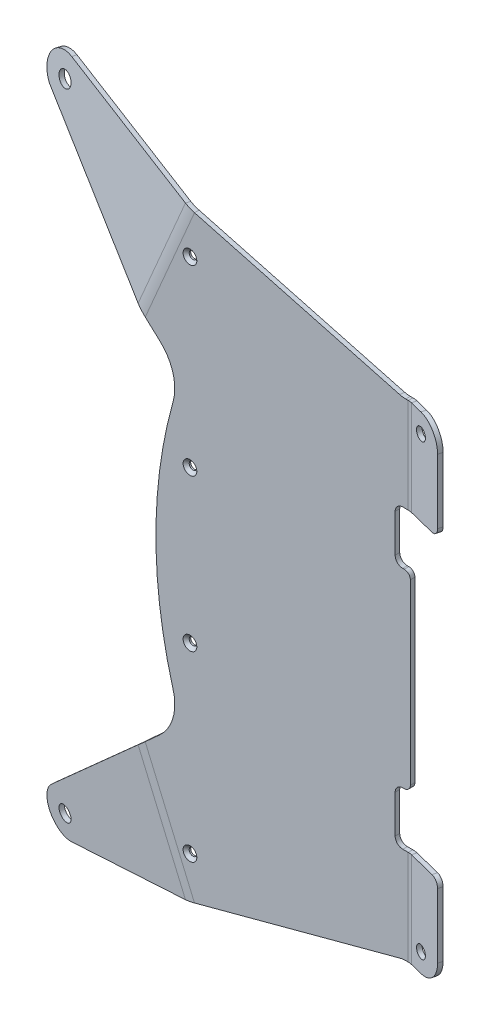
ISO-10303-21;
HEADER;
FILE_DESCRIPTION(('STEP AP214'),'2;1');
FILE_NAME('part.step','',(''),(''),'','','');
FILE_SCHEMA(('AUTOMOTIVE_DESIGN { 1 0 10303 214 1 1 1 1 }'));
ENDSEC;
DATA;
#1=APPLICATION_CONTEXT('core data for automotive mechanical design processes');
#2=APPLICATION_PROTOCOL_DEFINITION('international standard','automotive_design',2000,#1);
#3=PRODUCT_CONTEXT('',#1,'mechanical');
#4=PRODUCT('Part','Part','',(#3));
#5=PRODUCT_RELATED_PRODUCT_CATEGORY('part','',(#4));
#6=PRODUCT_DEFINITION_FORMATION('','',#4);
#7=PRODUCT_DEFINITION_CONTEXT('part definition',#1,'design');
#8=PRODUCT_DEFINITION('design','',#6,#7);
#9=PRODUCT_DEFINITION_SHAPE('','',#8);
#10=(LENGTH_UNIT() NAMED_UNIT(*) SI_UNIT(.MILLI.,.METRE.));
#11=(NAMED_UNIT(*) PLANE_ANGLE_UNIT() SI_UNIT($,.RADIAN.));
#12=(NAMED_UNIT(*) SI_UNIT($,.STERADIAN.) SOLID_ANGLE_UNIT());
#13=UNCERTAINTY_MEASURE_WITH_UNIT(LENGTH_MEASURE(1.E-05),#10,'distance_accuracy_value','');
#14=(GEOMETRIC_REPRESENTATION_CONTEXT(3) GLOBAL_UNCERTAINTY_ASSIGNED_CONTEXT((#13)) GLOBAL_UNIT_ASSIGNED_CONTEXT((#10,
#11,#12)) REPRESENTATION_CONTEXT('',''));
#15=CARTESIAN_POINT('',(0.,0.,0.));
#16=DIRECTION('',(0.,0.,1.));
#17=DIRECTION('',(1.,0.,0.));
#18=AXIS2_PLACEMENT_3D('',#15,#16,#17);
#19=CARTESIAN_POINT('',(-273.275617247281,-209.261116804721,-18.0795801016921));
#20=DIRECTION('',(0.191106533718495,0.081887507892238,-0.978147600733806));
#21=DIRECTION('',(-0.981537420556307,0.00791105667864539,-0.191106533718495));
#22=AXIS2_PLACEMENT_3D('',#19,#20,#21);
#23=CYLINDRICAL_SURFACE('',#22,5.);
#24=CARTESIAN_POINT('',(-273.275617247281,-209.261116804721,-18.0795801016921));
#25=DIRECTION('',(-0.191106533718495,-0.081887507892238,0.978147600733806));
#26=DIRECTION('',(0.981537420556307,-0.00791105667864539,0.191106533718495));
#27=AXIS2_PLACEMENT_3D('',#24,#25,#26);
#28=CIRCLE('',#27,5.);
#29=CARTESIAN_POINT('',(-268.367930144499,-209.300672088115,-17.1240474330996));
#30=VERTEX_POINT('',#29);
#31=EDGE_CURVE('E565',#30,#30,#28,.T.);
#32=ORIENTED_EDGE('',*,*,#31,.T.);
#33=EDGE_LOOP('',(#32));
#34=FACE_BOUND('',#33,.T.);
#35=CARTESIAN_POINT('',(-272.702297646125,-209.015454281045,-21.0140229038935));
#36=DIRECTION('',(-0.191106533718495,-0.081887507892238,0.978147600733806));
#37=DIRECTION('',(0.981537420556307,-0.00791105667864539,0.191106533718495));
#38=AXIS2_PLACEMENT_3D('',#35,#36,#37);
#39=CIRCLE('',#38,5.);
#40=CARTESIAN_POINT('',(-267.794610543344,-209.055009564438,-20.058490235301));
#41=VERTEX_POINT('',#40);
#42=EDGE_CURVE('E11',#41,#41,#39,.T.);
#43=ORIENTED_EDGE('',*,*,#42,.F.);
#44=EDGE_LOOP('',(#43));
#45=FACE_BOUND('',#44,.T.);
#46=ADVANCED_FACE('F30',(#34,#45),#23,.F.);
#47=CARTESIAN_POINT('',(-273.275617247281,-209.261116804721,-18.0795801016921));
#48=DIRECTION('',(0.191106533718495,0.081887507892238,-0.978147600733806));
#49=DIRECTION('',(-0.981537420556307,0.00791105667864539,-0.191106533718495));
#50=AXIS2_PLACEMENT_3D('',#47,#48,#49);
#51=CYLINDRICAL_SURFACE('',#50,15.0000000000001);
#52=CARTESIAN_POINT('',(-272.702297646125,-209.015454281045,-21.0140229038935));
#53=DIRECTION('',(-0.191106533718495,-0.081887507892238,0.978147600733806));
#54=DIRECTION('',(0.981537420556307,-0.00791105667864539,0.191106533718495));
#55=AXIS2_PLACEMENT_3D('',#52,#53,#54);
#56=CIRCLE('',#55,15.0000000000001);
#57=CARTESIAN_POINT('',(-282.699703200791,-197.879500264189,-22.0350078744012));
#58=VERTEX_POINT('',#57);
#59=CARTESIAN_POINT('',(-268.783569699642,-223.487658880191,-21.4599660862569));
#60=VERTEX_POINT('',#59);
#61=EDGE_CURVE('E64',#58,#60,#56,.T.);
#62=ORIENTED_EDGE('',*,*,#61,.T.);
#63=DIRECTION('',(0.191106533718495,0.081887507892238,-0.978147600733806));
#64=VECTOR('',#63,1.);
#65=CARTESIAN_POINT('',(-269.356889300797,-223.733321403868,-18.5255232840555));
#66=LINE('',#65,#64);
#67=CARTESIAN_POINT('',(-269.356889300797,-223.733321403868,-18.5255232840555));
#68=VERTEX_POINT('',#67);
#69=EDGE_CURVE('E553',#68,#60,#66,.T.);
#70=ORIENTED_EDGE('',*,*,#69,.F.);
#71=CARTESIAN_POINT('',(-273.275617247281,-209.261116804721,-18.0795801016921));
#72=DIRECTION('',(-0.191106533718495,-0.081887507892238,0.978147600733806));
#73=DIRECTION('',(0.981537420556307,-0.00791105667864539,0.191106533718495));
#74=AXIS2_PLACEMENT_3D('',#71,#72,#73);
#75=CIRCLE('',#74,15.0000000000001);
#76=CARTESIAN_POINT('',(-283.273022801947,-198.125162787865,-19.1005650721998));
#77=VERTEX_POINT('',#76);
#78=EDGE_CURVE('E557',#77,#68,#75,.T.);
#79=ORIENTED_EDGE('',*,*,#78,.F.);
#80=DIRECTION('',(0.191106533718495,0.081887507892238,-0.978147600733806));
#81=VECTOR('',#80,1.);
#82=CARTESIAN_POINT('',(-283.273022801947,-198.125162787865,-19.1005650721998));
#83=LINE('',#82,#81);
#84=EDGE_CURVE('E569',#77,#58,#83,.T.);
#85=ORIENTED_EDGE('',*,*,#84,.T.);
#86=EDGE_LOOP('',(#62,#70,#79,#85));
#87=FACE_BOUND('',#86,.T.);
#88=ADVANCED_FACE('F523',(#87),#51,.T.);
#89=CARTESIAN_POINT('',(-269.356889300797,-223.733321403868,-18.5255232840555));
#90=DIRECTION('',(-0.261248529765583,0.964813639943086,0.0297295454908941));
#91=DIRECTION('',(-0.946164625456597,-0.249858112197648,-0.205775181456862));
#92=AXIS2_PLACEMENT_3D('',#89,#90,#91);
#93=PLANE('',#92);
#94=CARTESIAN_POINT('',(-173.697239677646,-198.472030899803,2.27887082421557));
#95=CARTESIAN_POINT('',(-173.123920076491,-198.226368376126,-0.655571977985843));
#96=B_SPLINE_CURVE_WITH_KNOTS('',1,(#94,#95),.UNSPECIFIED.,.F.,.F.,(2,2),(0.,1.),.UNSPECIFIED.);
#97=CARTESIAN_POINT('',(-173.697239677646,-198.472030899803,2.27887082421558));
#98=VERTEX_POINT('',#97);
#99=CARTESIAN_POINT('',(-173.123920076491,-198.226368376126,-0.655571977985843));
#100=VERTEX_POINT('',#99);
#101=EDGE_CURVE('E419',#98,#100,#96,.T.);
#102=ORIENTED_EDGE('',*,*,#101,.F.);
#103=DIRECTION('',(0.946164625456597,0.249858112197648,0.205775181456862));
#104=VECTOR('',#103,1.);
#105=CARTESIAN_POINT('',(-269.356889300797,-223.733321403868,-18.5255232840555));
#106=LINE('',#105,#104);
#107=EDGE_CURVE('E552',#68,#98,#106,.T.);
#108=ORIENTED_EDGE('',*,*,#107,.F.);
#109=ORIENTED_EDGE('',*,*,#69,.T.);
#110=DIRECTION('',(0.946164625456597,0.249858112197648,0.205775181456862));
#111=VECTOR('',#110,1.);
#112=CARTESIAN_POINT('',(-268.783569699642,-223.487658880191,-21.4599660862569));
#113=LINE('',#112,#111);
#114=EDGE_CURVE('E549',#60,#100,#113,.T.);
#115=ORIENTED_EDGE('',*,*,#114,.T.);
#116=EDGE_LOOP('',(#102,#108,#109,#115));
#117=FACE_BOUND('',#116,.T.);
#118=ADVANCED_FACE('F527',(#117),#93,.F.);
#119=CARTESIAN_POINT('',(-276.598261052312,209.315158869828,16.3131732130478));
#120=DIRECTION('',(-0.191106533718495,-0.081887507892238,0.978147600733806));
#121=DIRECTION('',(0.981537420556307,-0.00791105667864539,0.191106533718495));
#122=AXIS2_PLACEMENT_3D('',#119,#120,#121);
#123=PLANE('',#122);
#124=ORIENTED_EDGE('',*,*,#31,.F.);
#125=EDGE_LOOP('',(#124));
#126=FACE_BOUND('',#125,.T.);
#127=ORIENTED_EDGE('',*,*,#107,.T.);
#128=DIRECTION('',(-0.393857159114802,0.919171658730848,0.));
#129=VECTOR('',#128,1.);
#130=CARTESIAN_POINT('',(-337.287674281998,183.310266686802,2.27887082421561));
#131=LINE('',#130,#129);
#132=CARTESIAN_POINT('',(-204.85267896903,-125.762430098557,2.27887082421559));
#133=VERTEX_POINT('',#132);
#134=EDGE_CURVE('E576',#98,#133,#131,.T.);
#135=ORIENTED_EDGE('',*,*,#134,.T.);
#136=DIRECTION('',(-0.720600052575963,-0.664937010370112,-0.196454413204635));
#137=VECTOR('',#136,1.);
#138=CARTESIAN_POINT('',(-190.430200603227,-112.454021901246,6.21081547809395));
#139=LINE('',#138,#137);
#140=EDGE_CURVE('E561',#133,#77,#139,.T.);
#141=ORIENTED_EDGE('',*,*,#140,.T.);
#142=ORIENTED_EDGE('',*,*,#78,.T.);
#143=EDGE_LOOP('',(#127,#135,#141,#142));
#144=FACE_BOUND('',#143,.T.);
#145=ADVANCED_FACE('F531',(#126,#144),#123,.T.);
#146=CARTESIAN_POINT('',(-190.430200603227,-112.454021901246,6.21081547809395));
#147=DIRECTION('',(0.666493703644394,-0.742396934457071,0.06806566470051));
#148=DIRECTION('',(0.720600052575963,0.664937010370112,0.196454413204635));
#149=AXIS2_PLACEMENT_3D('',#146,#147,#148);
#150=PLANE('',#149);
#151=CARTESIAN_POINT('',(-204.279359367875,-125.516767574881,-0.655571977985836));
#152=CARTESIAN_POINT('',(-204.85267896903,-125.762430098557,2.27887082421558));
#153=B_SPLINE_CURVE_WITH_KNOTS('',1,(#151,#152),.UNSPECIFIED.,.F.,.F.,(2,2),(0.,1.),.UNSPECIFIED.);
#154=CARTESIAN_POINT('',(-204.279359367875,-125.516767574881,-0.655571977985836));
#155=VERTEX_POINT('',#154);
#156=EDGE_CURVE('E546',#155,#133,#153,.T.);
#157=ORIENTED_EDGE('',*,*,#156,.F.);
#158=DIRECTION('',(-0.720600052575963,-0.664937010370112,-0.196454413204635));
#159=VECTOR('',#158,1.);
#160=CARTESIAN_POINT('',(-189.856881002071,-112.208359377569,3.27637267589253));
#161=LINE('',#160,#159);
#162=EDGE_CURVE('E41',#155,#58,#161,.T.);
#163=ORIENTED_EDGE('',*,*,#162,.T.);
#164=ORIENTED_EDGE('',*,*,#84,.F.);
#165=ORIENTED_EDGE('',*,*,#140,.F.);
#166=EDGE_LOOP('',(#157,#163,#164,#165));
#167=FACE_BOUND('',#166,.T.);
#168=ADVANCED_FACE('F560',(#167),#150,.F.);
#169=CARTESIAN_POINT('',(-276.024941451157,209.560821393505,13.3787304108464));
#170=DIRECTION('',(-0.191106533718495,-0.081887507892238,0.978147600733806));
#171=DIRECTION('',(0.981537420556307,-0.00791105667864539,0.191106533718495));
#172=AXIS2_PLACEMENT_3D('',#169,#170,#171);
#173=PLANE('',#172);
#174=DIRECTION('',(-0.393857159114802,0.919171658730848,0.));
#175=VECTOR('',#174,1.);
#176=CARTESIAN_POINT('',(-336.714354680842,183.555929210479,-0.655571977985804));
#177=LINE('',#176,#175);
#178=EDGE_CURVE('E539',#100,#155,#177,.T.);
#179=ORIENTED_EDGE('',*,*,#178,.F.);
#180=ORIENTED_EDGE('',*,*,#114,.F.);
#181=ORIENTED_EDGE('',*,*,#61,.F.);
#182=ORIENTED_EDGE('',*,*,#162,.F.);
#183=EDGE_LOOP('',(#179,#180,#181,#182));
#184=FACE_BOUND('',#183,.T.);
#185=ORIENTED_EDGE('',*,*,#42,.T.);
#186=EDGE_LOOP('',(#185));
#187=FACE_BOUND('',#186,.T.);
#188=ADVANCED_FACE('F32',(#184,#187),#173,.F.);
#189=CARTESIAN_POINT('',(-273.275246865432,209.26152373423,-18.0812950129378));
#190=DIRECTION('',(0.1911292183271,-0.0818345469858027,-0.978147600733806));
#191=DIRECTION('',(-0.981533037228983,-0.00790687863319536,-0.1911292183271));
#192=AXIS2_PLACEMENT_3D('',#189,#190,#191);
#193=CYLINDRICAL_SURFACE('',#192,5.00000000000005);
#194=CARTESIAN_POINT('',(-273.275246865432,209.26152373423,-18.0812950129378));
#195=DIRECTION('',(-0.1911292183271,0.0818345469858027,0.978147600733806));
#196=DIRECTION('',(0.981533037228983,0.00790687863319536,0.1911292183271));
#197=AXIS2_PLACEMENT_3D('',#194,#195,#196);
#198=CIRCLE('',#197,5.00000000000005);
#199=CARTESIAN_POINT('',(-268.367581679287,209.301058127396,-17.1256489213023));
#200=VERTEX_POINT('',#199);
#201=EDGE_CURVE('E613',#200,#200,#198,.T.);
#202=ORIENTED_EDGE('',*,*,#201,.T.);
#203=EDGE_LOOP('',(#202));
#204=FACE_BOUND('',#203,.T.);
#205=CARTESIAN_POINT('',(-272.701859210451,209.016020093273,-21.0157378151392));
#206=DIRECTION('',(-0.1911292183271,0.0818345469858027,0.978147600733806));
#207=DIRECTION('',(0.981533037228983,0.00790687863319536,0.1911292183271));
#208=AXIS2_PLACEMENT_3D('',#205,#206,#207);
#209=CIRCLE('',#208,5.00000000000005);
#210=CARTESIAN_POINT('',(-267.794194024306,209.055554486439,-20.0600917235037));
#211=VERTEX_POINT('',#210);
#212=EDGE_CURVE('E588',#211,#211,#209,.T.);
#213=ORIENTED_EDGE('',*,*,#212,.F.);
#214=EDGE_LOOP('',(#213));
#215=FACE_BOUND('',#214,.T.);
#216=ADVANCED_FACE('F650',(#204,#215),#193,.F.);
#217=CARTESIAN_POINT('',(-273.275246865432,209.26152373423,-18.0812950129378));
#218=DIRECTION('',(0.1911292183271,-0.0818345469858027,-0.978147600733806));
#219=DIRECTION('',(-0.981533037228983,-0.00790687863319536,-0.1911292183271));
#220=AXIS2_PLACEMENT_3D('',#217,#218,#219);
#221=CYLINDRICAL_SURFACE('',#220,15.0000000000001);
#222=CARTESIAN_POINT('',(-272.701859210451,209.016020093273,-21.0157378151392));
#223=DIRECTION('',(-0.1911292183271,0.0818345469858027,0.978147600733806));
#224=DIRECTION('',(0.981533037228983,0.00790687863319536,0.1911292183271));
#225=AXIS2_PLACEMENT_3D('',#222,#223,#224);
#226=CIRCLE('',#225,15.0000000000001);
#227=CARTESIAN_POINT('',(-268.783208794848,223.488272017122,-21.4608256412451));
#228=VERTEX_POINT('',#227);
#229=CARTESIAN_POINT('',(-284.455333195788,199.822395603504,-22.5431925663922));
#230=VERTEX_POINT('',#229);
#231=EDGE_CURVE('E611',#228,#230,#226,.T.);
#232=ORIENTED_EDGE('',*,*,#231,.T.);
#233=DIRECTION('',(0.1911292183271,-0.0818345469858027,-0.978147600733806));
#234=VECTOR('',#233,1.);
#235=CARTESIAN_POINT('',(-285.028720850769,200.067899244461,-19.6087497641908));
#236=LINE('',#235,#234);
#237=CARTESIAN_POINT('',(-285.028720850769,200.067899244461,-19.6087497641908));
#238=VERTEX_POINT('',#237);
#239=EDGE_CURVE('E608',#238,#230,#236,.T.);
#240=ORIENTED_EDGE('',*,*,#239,.F.);
#241=CARTESIAN_POINT('',(-273.275246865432,209.26152373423,-18.0812950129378));
#242=DIRECTION('',(-0.1911292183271,0.0818345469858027,0.978147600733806));
#243=DIRECTION('',(0.981533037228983,0.00790687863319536,0.1911292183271));
#244=AXIS2_PLACEMENT_3D('',#241,#242,#243);
#245=CIRCLE('',#244,15.0000000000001);
#246=CARTESIAN_POINT('',(-269.35659644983,223.733775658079,-18.5263828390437));
#247=VERTEX_POINT('',#246);
#248=EDGE_CURVE('E603',#247,#238,#245,.T.);
#249=ORIENTED_EDGE('',*,*,#248,.F.);
#250=DIRECTION('',(0.1911292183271,-0.0818345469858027,-0.978147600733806));
#251=VECTOR('',#250,1.);
#252=CARTESIAN_POINT('',(-269.35659644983,223.733775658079,-18.5263828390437));
#253=LINE('',#252,#251);
#254=EDGE_CURVE('E97',#247,#228,#253,.T.);
#255=ORIENTED_EDGE('',*,*,#254,.T.);
#256=EDGE_LOOP('',(#232,#240,#249,#255));
#257=FACE_BOUND('',#256,.T.);
#258=ADVANCED_FACE('F647',(#257),#221,.T.);
#259=CARTESIAN_POINT('',(-285.028720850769,200.067899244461,-19.6087497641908));
#260=DIRECTION('',(0.667785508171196,0.74119755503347,0.0684740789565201));
#261=DIRECTION('',(-0.719397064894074,0.666280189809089,-0.196312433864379));
#262=AXIS2_PLACEMENT_3D('',#259,#260,#261);
#263=PLANE('',#262);
#264=CARTESIAN_POINT('',(-204.820403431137,125.78178443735,2.27887082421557));
#265=CARTESIAN_POINT('',(-204.247015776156,125.536280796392,-0.655571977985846));
#266=B_SPLINE_CURVE_WITH_KNOTS('',1,(#264,#265),.UNSPECIFIED.,.F.,.F.,(2,2),(0.,1.),.UNSPECIFIED.);
#267=CARTESIAN_POINT('',(-204.820403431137,125.78178443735,2.27887082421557));
#268=VERTEX_POINT('',#267);
#269=CARTESIAN_POINT('',(-204.247015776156,125.536280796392,-0.655571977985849));
#270=VERTEX_POINT('',#269);
#271=EDGE_CURVE('E633',#268,#270,#266,.T.);
#272=ORIENTED_EDGE('',*,*,#271,.F.);
#273=DIRECTION('',(0.719397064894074,-0.666280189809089,0.196312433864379));
#274=VECTOR('',#273,1.);
#275=CARTESIAN_POINT('',(-285.028720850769,200.067899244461,-19.6087497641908));
#276=LINE('',#275,#274);
#277=EDGE_CURVE('E619',#238,#268,#276,.T.);
#278=ORIENTED_EDGE('',*,*,#277,.F.);
#279=ORIENTED_EDGE('',*,*,#239,.T.);
#280=DIRECTION('',(0.719397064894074,-0.666280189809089,0.196312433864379));
#281=VECTOR('',#280,1.);
#282=CARTESIAN_POINT('',(-284.455333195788,199.822395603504,-22.5431925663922));
#283=LINE('',#282,#281);
#284=EDGE_CURVE('E82',#230,#270,#283,.T.);
#285=ORIENTED_EDGE('',*,*,#284,.T.);
#286=EDGE_LOOP('',(#272,#278,#279,#285));
#287=FACE_BOUND('',#286,.T.);
#288=ADVANCED_FACE('F638',(#287),#263,.F.);
#289=CARTESIAN_POINT('',(-273.275246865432,209.26152373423,-18.0812950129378));
#290=DIRECTION('',(-0.1911292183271,0.0818345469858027,0.978147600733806));
#291=DIRECTION('',(0.981533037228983,0.00790687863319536,0.1911292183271));
#292=AXIS2_PLACEMENT_3D('',#289,#290,#291);
#293=PLANE('',#292);
#294=ORIENTED_EDGE('',*,*,#201,.F.);
#295=EDGE_LOOP('',(#294));
#296=FACE_BOUND('',#295,.T.);
#297=ORIENTED_EDGE('',*,*,#277,.T.);
#298=DIRECTION('',(0.393602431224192,0.919280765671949,0.));
#299=VECTOR('',#298,1.);
#300=CARTESIAN_POINT('',(-185.220054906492,171.559508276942,2.27887082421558));
#301=LINE('',#300,#299);
#302=CARTESIAN_POINT('',(-173.6971396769,198.471929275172,2.27887082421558));
#303=VERTEX_POINT('',#302);
#304=EDGE_CURVE('E607',#268,#303,#301,.T.);
#305=ORIENTED_EDGE('',*,*,#304,.T.);
#306=DIRECTION('',(0.946161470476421,-0.249863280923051,0.205783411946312));
#307=VECTOR('',#306,1.);
#308=CARTESIAN_POINT('',(-269.35659644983,223.733775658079,-18.5263828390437));
#309=LINE('',#308,#307);
#310=EDGE_CURVE('E606',#247,#303,#309,.T.);
#311=ORIENTED_EDGE('',*,*,#310,.F.);
#312=ORIENTED_EDGE('',*,*,#248,.T.);
#313=EDGE_LOOP('',(#297,#305,#311,#312));
#314=FACE_BOUND('',#313,.T.);
#315=ADVANCED_FACE('F467',(#296,#314),#293,.T.);
#316=CARTESIAN_POINT('',(-269.35659644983,223.733775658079,-18.5263828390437));
#317=DIRECTION('',(0.261243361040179,0.964816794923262,-0.0296725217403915));
#318=DIRECTION('',(-0.946161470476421,0.249863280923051,-0.205783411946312));
#319=AXIS2_PLACEMENT_3D('',#316,#317,#318);
#320=PLANE('',#319);
#321=ORIENTED_EDGE('',*,*,#310,.T.);
#322=CARTESIAN_POINT('',(-173.123752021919,198.226425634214,-0.655571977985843));
#323=CARTESIAN_POINT('',(-173.6971396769,198.471929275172,2.27887082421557));
#324=B_SPLINE_CURVE_WITH_KNOTS('',1,(#322,#323),.UNSPECIFIED.,.F.,.F.,(2,2),(0.,1.),.UNSPECIFIED.);
#325=CARTESIAN_POINT('',(-173.123752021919,198.226425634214,-0.655571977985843));
#326=VERTEX_POINT('',#325);
#327=EDGE_CURVE('E595',#303,#326,#324,.F.);
#328=ORIENTED_EDGE('',*,*,#327,.T.);
#329=DIRECTION('',(0.946161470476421,-0.249863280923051,0.205783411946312));
#330=VECTOR('',#329,1.);
#331=CARTESIAN_POINT('',(-268.783208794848,223.488272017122,-21.4608256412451));
#332=LINE('',#331,#330);
#333=EDGE_CURVE('E590',#228,#326,#332,.T.);
#334=ORIENTED_EDGE('',*,*,#333,.F.);
#335=ORIENTED_EDGE('',*,*,#254,.F.);
#336=EDGE_LOOP('',(#321,#328,#334,#335));
#337=FACE_BOUND('',#336,.T.);
#338=ADVANCED_FACE('F456',(#337),#320,.T.);
#339=CARTESIAN_POINT('',(-272.701859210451,209.016020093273,-21.0157378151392));
#340=DIRECTION('',(-0.1911292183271,0.0818345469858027,0.978147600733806));
#341=DIRECTION('',(0.981533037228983,0.00790687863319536,0.1911292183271));
#342=AXIS2_PLACEMENT_3D('',#339,#340,#341);
#343=PLANE('',#342);
#344=DIRECTION('',(0.393602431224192,0.919280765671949,0.));
#345=VECTOR('',#344,1.);
#346=CARTESIAN_POINT('',(-184.646667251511,171.314004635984,-0.655571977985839));
#347=LINE('',#346,#345);
#348=EDGE_CURVE('E616',#270,#326,#347,.T.);
#349=ORIENTED_EDGE('',*,*,#348,.F.);
#350=ORIENTED_EDGE('',*,*,#284,.F.);
#351=ORIENTED_EDGE('',*,*,#231,.F.);
#352=ORIENTED_EDGE('',*,*,#333,.T.);
#353=EDGE_LOOP('',(#349,#350,#351,#352));
#354=FACE_BOUND('',#353,.T.);
#355=ORIENTED_EDGE('',*,*,#212,.T.);
#356=EDGE_LOOP('',(#355));
#357=FACE_BOUND('',#356,.T.);
#358=ADVANCED_FACE('F466',(#354,#357),#343,.F.);
#359=CARTESIAN_POINT('',(-15.6460696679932,-147.5,5.37636383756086));
#360=DIRECTION('',(0.241921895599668,0.,-0.970295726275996));
#361=DIRECTION('',(-0.970295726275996,0.,-0.241921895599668));
#362=AXIS2_PLACEMENT_3D('',#359,#360,#361);
#363=CYLINDRICAL_SURFACE('',#362,4.);
#364=CARTESIAN_POINT('',(-15.6460696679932,-147.5,5.37636383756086));
#365=DIRECTION('',(-0.241921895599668,0.,0.970295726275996));
#366=DIRECTION('',(0.970295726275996,0.,0.241921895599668));
#367=AXIS2_PLACEMENT_3D('',#364,#365,#366);
#368=CIRCLE('',#367,4.);
#369=CARTESIAN_POINT('',(-11.7648867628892,-147.5,6.34405141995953));
#370=VERTEX_POINT('',#369);
#371=EDGE_CURVE('E915',#370,#370,#368,.T.);
#372=ORIENTED_EDGE('',*,*,#371,.T.);
#373=EDGE_LOOP('',(#372));
#374=FACE_BOUND('',#373,.T.);
#375=CARTESIAN_POINT('',(-14.9203039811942,-147.5,2.46547665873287));
#376=DIRECTION('',(-0.241921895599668,0.,0.970295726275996));
#377=DIRECTION('',(0.970295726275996,0.,0.241921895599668));
#378=AXIS2_PLACEMENT_3D('',#375,#376,#377);
#379=CIRCLE('',#378,4.);
#380=CARTESIAN_POINT('',(-11.0391210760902,-147.5,3.43316424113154));
#381=VERTEX_POINT('',#380);
#382=EDGE_CURVE('E888',#381,#381,#379,.T.);
#383=ORIENTED_EDGE('',*,*,#382,.F.);
#384=EDGE_LOOP('',(#383));
#385=FACE_BOUND('',#384,.T.);
#386=ADVANCED_FACE('F472',(#374,#385),#363,.F.);
#387=CARTESIAN_POINT('',(-1.09163377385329,-145.,9.00519227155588));
#388=DIRECTION('',(-0.970295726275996,0.,-0.241921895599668));
#389=DIRECTION('',(-0.241921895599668,0.,0.970295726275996));
#390=AXIS2_PLACEMENT_3D('',#387,#388,#389);
#391=PLANE('',#390);
#392=DIRECTION('',(0.,1.,0.));
#393=VECTOR('',#392,1.);
#394=CARTESIAN_POINT('',(-0.365868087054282,-145.,6.09430509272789));
#395=LINE('',#394,#393);
#396=CARTESIAN_POINT('',(-0.365868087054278,-145.,6.09430509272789));
#397=VERTEX_POINT('',#396);
#398=CARTESIAN_POINT('',(-0.365868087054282,-102.5,6.09430509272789));
#399=VERTEX_POINT('',#398);
#400=EDGE_CURVE('E913',#397,#399,#395,.T.);
#401=ORIENTED_EDGE('',*,*,#400,.T.);
#402=DIRECTION('',(0.241921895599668,0.,-0.970295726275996));
#403=VECTOR('',#402,1.);
#404=CARTESIAN_POINT('',(-1.09163377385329,-102.5,9.00519227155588));
#405=LINE('',#404,#403);
#406=CARTESIAN_POINT('',(-1.09163377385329,-102.5,9.00519227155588));
#407=VERTEX_POINT('',#406);
#408=EDGE_CURVE('E904',#407,#399,#405,.T.);
#409=ORIENTED_EDGE('',*,*,#408,.F.);
#410=DIRECTION('',(0.,1.,0.));
#411=VECTOR('',#410,1.);
#412=CARTESIAN_POINT('',(-1.09163377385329,-145.,9.00519227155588));
#413=LINE('',#412,#411);
#414=CARTESIAN_POINT('',(-1.09163377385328,-145.,9.00519227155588));
#415=VERTEX_POINT('',#414);
#416=EDGE_CURVE('E114',#415,#407,#413,.T.);
#417=ORIENTED_EDGE('',*,*,#416,.F.);
#418=DIRECTION('',(0.241921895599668,0.,-0.970295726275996));
#419=VECTOR('',#418,1.);
#420=CARTESIAN_POINT('',(-1.09163377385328,-145.,9.00519227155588));
#421=LINE('',#420,#419);
#422=EDGE_CURVE('E910',#415,#397,#421,.T.);
#423=ORIENTED_EDGE('',*,*,#422,.T.);
#424=EDGE_LOOP('',(#401,#409,#417,#423));
#425=FACE_BOUND('',#424,.T.);
#426=ADVANCED_FACE('F1184',(#425),#391,.F.);
#427=CARTESIAN_POINT('',(-5.94311240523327,-102.5,7.79558279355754));
#428=DIRECTION('',(0.241921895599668,0.,-0.970295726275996));
#429=DIRECTION('',(-0.970295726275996,0.,-0.241921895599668));
#430=AXIS2_PLACEMENT_3D('',#427,#428,#429);
#431=CYLINDRICAL_SURFACE('',#430,5.);
#432=CARTESIAN_POINT('',(-5.21734671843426,-102.5,4.88469561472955));
#433=DIRECTION('',(-0.241921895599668,0.,0.970295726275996));
#434=DIRECTION('',(0.970295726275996,0.,0.241921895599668));
#435=AXIS2_PLACEMENT_3D('',#432,#433,#434);
#436=CIRCLE('',#435,5.);
#437=CARTESIAN_POINT('',(-5.21734671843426,-97.5,4.88469561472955));
#438=VERTEX_POINT('',#437);
#439=EDGE_CURVE('E907',#399,#438,#436,.T.);
#440=ORIENTED_EDGE('',*,*,#439,.T.);
#441=DIRECTION('',(0.241921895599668,0.,-0.970295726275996));
#442=VECTOR('',#441,1.);
#443=CARTESIAN_POINT('',(-5.94311240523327,-97.5,7.79558279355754));
#444=LINE('',#443,#442);
#445=CARTESIAN_POINT('',(-5.94311240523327,-97.5,7.79558279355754));
#446=VERTEX_POINT('',#445);
#447=EDGE_CURVE('E881',#446,#438,#444,.T.);
#448=ORIENTED_EDGE('',*,*,#447,.F.);
#449=CARTESIAN_POINT('',(-5.94311240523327,-102.5,7.79558279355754));
#450=DIRECTION('',(-0.241921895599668,0.,0.970295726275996));
#451=DIRECTION('',(0.970295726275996,0.,0.241921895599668));
#452=AXIS2_PLACEMENT_3D('',#449,#450,#451);
#453=CIRCLE('',#452,5.);
#454=EDGE_CURVE('E875',#407,#446,#453,.T.);
#455=ORIENTED_EDGE('',*,*,#454,.F.);
#456=ORIENTED_EDGE('',*,*,#408,.T.);
#457=EDGE_LOOP('',(#440,#448,#455,#456));
#458=FACE_BOUND('',#457,.T.);
#459=ADVANCED_FACE('F1188',(#458),#431,.T.);
#460=CARTESIAN_POINT('',(-15.6460696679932,-145.,5.37636383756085));
#461=DIRECTION('',(0.241921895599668,0.,-0.970295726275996));
#462=DIRECTION('',(-0.970295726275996,0.,-0.241921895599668));
#463=AXIS2_PLACEMENT_3D('',#460,#461,#462);
#464=CYLINDRICAL_SURFACE('',#463,15.);
#465=CARTESIAN_POINT('',(-14.9203039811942,-145.,2.46547665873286));
#466=DIRECTION('',(-0.241921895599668,0.,0.970295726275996));
#467=DIRECTION('',(0.970295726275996,0.,0.241921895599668));
#468=AXIS2_PLACEMENT_3D('',#465,#466,#467);
#469=CIRCLE('',#468,15.);
#470=CARTESIAN_POINT('',(-14.9203039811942,-160.,2.46547665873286));
#471=VERTEX_POINT('',#470);
#472=EDGE_CURVE('E902',#471,#397,#469,.T.);
#473=ORIENTED_EDGE('',*,*,#472,.T.);
#474=ORIENTED_EDGE('',*,*,#422,.F.);
#475=CARTESIAN_POINT('',(-15.6460696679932,-145.,5.37636383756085));
#476=DIRECTION('',(-0.241921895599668,0.,0.970295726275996));
#477=DIRECTION('',(0.970295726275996,0.,0.241921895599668));
#478=AXIS2_PLACEMENT_3D('',#475,#476,#477);
#479=CIRCLE('',#478,15.);
#480=CARTESIAN_POINT('',(-15.6460696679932,-160.,5.37636383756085));
#481=VERTEX_POINT('',#480);
#482=EDGE_CURVE('E878',#481,#415,#479,.T.);
#483=ORIENTED_EDGE('',*,*,#482,.F.);
#484=DIRECTION('',(0.241921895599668,0.,-0.970295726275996));
#485=VECTOR('',#484,1.);
#486=CARTESIAN_POINT('',(-15.6460696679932,-160.,5.37636383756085));
#487=LINE('',#486,#485);
#488=EDGE_CURVE('E900',#481,#471,#487,.T.);
#489=ORIENTED_EDGE('',*,*,#488,.T.);
#490=EDGE_LOOP('',(#473,#474,#483,#489));
#491=FACE_BOUND('',#490,.T.);
#492=ADVANCED_FACE('F1192',(#491),#464,.T.);
#493=CARTESIAN_POINT('',(-15.6460696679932,-160.,5.37636383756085));
#494=DIRECTION('',(0.,-1.,0.));
#495=DIRECTION('',(0.241921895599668,0.,-0.970295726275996));
#496=AXIS2_PLACEMENT_3D('',#493,#494,#495);
#497=PLANE('',#496);
#498=DIRECTION('',(-0.970295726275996,0.,-0.241921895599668));
#499=VECTOR('',#498,1.);
#500=CARTESIAN_POINT('',(-15.6460696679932,-160.,5.37636383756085));
#501=LINE('',#500,#499);
#502=CARTESIAN_POINT('',(-23.9857710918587,-160.,3.29704273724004));
#503=VERTEX_POINT('',#502);
#504=EDGE_CURVE('E898',#481,#503,#501,.T.);
#505=ORIENTED_EDGE('',*,*,#504,.T.);
#506=DIRECTION('',(0.241921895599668,0.,-0.970295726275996));
#507=VECTOR('',#506,1.);
#508=CARTESIAN_POINT('',(-23.9857710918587,-160.,3.29704273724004));
#509=LINE('',#508,#507);
#510=CARTESIAN_POINT('',(-23.2600054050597,-160.,0.38615555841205));
#511=VERTEX_POINT('',#510);
#512=EDGE_CURVE('E895',#503,#511,#509,.T.);
#513=ORIENTED_EDGE('',*,*,#512,.T.);
#514=DIRECTION('',(-0.970295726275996,0.,-0.241921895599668));
#515=VECTOR('',#514,1.);
#516=CARTESIAN_POINT('',(-14.9203039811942,-160.,2.46547665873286));
#517=LINE('',#516,#515);
#518=EDGE_CURVE('E891',#471,#511,#517,.T.);
#519=ORIENTED_EDGE('',*,*,#518,.F.);
#520=ORIENTED_EDGE('',*,*,#488,.F.);
#521=EDGE_LOOP('',(#505,#513,#519,#520));
#522=FACE_BOUND('',#521,.T.);
#523=ADVANCED_FACE('F1196',(#522),#497,.T.);
#524=CARTESIAN_POINT('',(-267.197192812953,210.,-60.4342161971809));
#525=DIRECTION('',(-0.241921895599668,0.,0.970295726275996));
#526=DIRECTION('',(0.970295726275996,0.,0.241921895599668));
#527=AXIS2_PLACEMENT_3D('',#524,#525,#526);
#528=PLANE('',#527);
#529=DIRECTION('',(0.,-1.,0.));
#530=VECTOR('',#529,1.);
#531=CARTESIAN_POINT('',(-23.2600054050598,210.,0.386155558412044));
#532=LINE('',#531,#530);
#533=CARTESIAN_POINT('',(-23.2600054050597,-97.5,0.386155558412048));
#534=VERTEX_POINT('',#533);
#535=EDGE_CURVE('E146',#534,#511,#532,.T.);
#536=ORIENTED_EDGE('',*,*,#535,.F.);
#537=DIRECTION('',(0.970295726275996,0.,0.241921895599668));
#538=VECTOR('',#537,1.);
#539=CARTESIAN_POINT('',(-29.4747398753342,-97.5,-1.16335177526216));
#540=LINE('',#539,#538);
#541=EDGE_CURVE('E893',#534,#438,#540,.T.);
#542=ORIENTED_EDGE('',*,*,#541,.T.);
#543=ORIENTED_EDGE('',*,*,#439,.F.);
#544=ORIENTED_EDGE('',*,*,#400,.F.);
#545=ORIENTED_EDGE('',*,*,#472,.F.);
#546=ORIENTED_EDGE('',*,*,#518,.T.);
#547=EDGE_LOOP('',(#536,#542,#543,#544,#545,#546));
#548=FACE_BOUND('',#547,.T.);
#549=ORIENTED_EDGE('',*,*,#382,.T.);
#550=EDGE_LOOP('',(#549));
#551=FACE_BOUND('',#550,.T.);
#552=ADVANCED_FACE('F1200',(#548,#551),#528,.F.);
#553=CARTESIAN_POINT('',(-30.2005055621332,-97.5,1.74753540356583));
#554=DIRECTION('',(0.,1.,0.));
#555=DIRECTION('',(-0.970295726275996,0.,-0.241921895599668));
#556=AXIS2_PLACEMENT_3D('',#553,#554,#555);
#557=PLANE('',#556);
#558=ORIENTED_EDGE('',*,*,#541,.F.);
#559=DIRECTION('',(-0.241921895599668,0.,0.970295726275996));
#560=VECTOR('',#559,1.);
#561=CARTESIAN_POINT('',(-23.9857710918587,-97.5,3.29704273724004));
#562=LINE('',#561,#560);
#563=CARTESIAN_POINT('',(-23.9857710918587,-97.5,3.29704273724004));
#564=VERTEX_POINT('',#563);
#565=EDGE_CURVE('E886',#534,#564,#562,.T.);
#566=ORIENTED_EDGE('',*,*,#565,.T.);
#567=DIRECTION('',(0.970295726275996,0.,0.241921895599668));
#568=VECTOR('',#567,1.);
#569=CARTESIAN_POINT('',(-30.2005055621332,-97.5,1.74753540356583));
#570=LINE('',#569,#568);
#571=EDGE_CURVE('E884',#564,#446,#570,.T.);
#572=ORIENTED_EDGE('',*,*,#571,.T.);
#573=ORIENTED_EDGE('',*,*,#447,.T.);
#574=EDGE_LOOP('',(#558,#566,#572,#573));
#575=FACE_BOUND('',#574,.T.);
#576=ADVANCED_FACE('F1203',(#575),#557,.T.);
#577=CARTESIAN_POINT('',(-267.922958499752,210.,-57.5233290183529));
#578=DIRECTION('',(-0.241921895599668,0.,0.970295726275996));
#579=DIRECTION('',(0.970295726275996,0.,0.241921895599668));
#580=AXIS2_PLACEMENT_3D('',#577,#578,#579);
#581=PLANE('',#580);
#582=ORIENTED_EDGE('',*,*,#371,.F.);
#583=EDGE_LOOP('',(#582));
#584=FACE_BOUND('',#583,.T.);
#585=ORIENTED_EDGE('',*,*,#571,.F.);
#586=DIRECTION('',(0.,-1.,0.));
#587=VECTOR('',#586,1.);
#588=CARTESIAN_POINT('',(-23.9857710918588,210.,3.29704273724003));
#589=LINE('',#588,#587);
#590=EDGE_CURVE('E153',#564,#503,#589,.T.);
#591=ORIENTED_EDGE('',*,*,#590,.T.);
#592=ORIENTED_EDGE('',*,*,#504,.F.);
#593=ORIENTED_EDGE('',*,*,#482,.T.);
#594=ORIENTED_EDGE('',*,*,#416,.T.);
#595=ORIENTED_EDGE('',*,*,#454,.T.);
#596=EDGE_LOOP('',(#585,#591,#592,#593,#594,#595));
#597=FACE_BOUND('',#596,.T.);
#598=ADVANCED_FACE('F665',(#584,#597),#581,.T.);
#599=CARTESIAN_POINT('',(-15.6460696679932,147.5,5.37636383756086));
#600=DIRECTION('',(0.241921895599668,0.,-0.970295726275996));
#601=DIRECTION('',(-0.970295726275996,0.,-0.241921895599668));
#602=AXIS2_PLACEMENT_3D('',#599,#600,#601);
#603=CYLINDRICAL_SURFACE('',#602,4.);
#604=CARTESIAN_POINT('',(-15.6460696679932,147.5,5.37636383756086));
#605=DIRECTION('',(-0.241921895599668,0.,0.970295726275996));
#606=DIRECTION('',(0.970295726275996,0.,0.241921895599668));
#607=AXIS2_PLACEMENT_3D('',#604,#605,#606);
#608=CIRCLE('',#607,4.);
#609=CARTESIAN_POINT('',(-11.7648867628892,147.5,6.34405141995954));
#610=VERTEX_POINT('',#609);
#611=EDGE_CURVE('E859',#610,#610,#608,.T.);
#612=ORIENTED_EDGE('',*,*,#611,.T.);
#613=EDGE_LOOP('',(#612));
#614=FACE_BOUND('',#613,.T.);
#615=CARTESIAN_POINT('',(-14.9203039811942,147.5,2.46547665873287));
#616=DIRECTION('',(-0.241921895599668,0.,0.970295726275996));
#617=DIRECTION('',(0.970295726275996,0.,0.241921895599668));
#618=AXIS2_PLACEMENT_3D('',#615,#616,#617);
#619=CIRCLE('',#618,4.);
#620=CARTESIAN_POINT('',(-11.0391210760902,147.5,3.43316424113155));
#621=VERTEX_POINT('',#620);
#622=EDGE_CURVE('E835',#621,#621,#619,.T.);
#623=ORIENTED_EDGE('',*,*,#622,.F.);
#624=EDGE_LOOP('',(#623));
#625=FACE_BOUND('',#624,.T.);
#626=ADVANCED_FACE('F1146',(#614,#625),#603,.F.);
#627=CARTESIAN_POINT('',(-1.09163377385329,102.5,9.00519227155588));
#628=DIRECTION('',(-0.970295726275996,0.,-0.241921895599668));
#629=DIRECTION('',(-0.241921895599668,0.,0.970295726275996));
#630=AXIS2_PLACEMENT_3D('',#627,#628,#629);
#631=PLANE('',#630);
#632=DIRECTION('',(0.,1.,0.));
#633=VECTOR('',#632,1.);
#634=CARTESIAN_POINT('',(-0.365868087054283,102.5,6.0943050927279));
#635=LINE('',#634,#633);
#636=CARTESIAN_POINT('',(-0.36586808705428,102.5,6.0943050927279));
#637=VERTEX_POINT('',#636);
#638=CARTESIAN_POINT('',(-0.365868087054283,145.,6.0943050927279));
#639=VERTEX_POINT('',#638);
#640=EDGE_CURVE('E857',#637,#639,#635,.T.);
#641=ORIENTED_EDGE('',*,*,#640,.T.);
#642=DIRECTION('',(0.241921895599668,0.,-0.970295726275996));
#643=VECTOR('',#642,1.);
#644=CARTESIAN_POINT('',(-1.09163377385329,145.,9.00519227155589));
#645=LINE('',#644,#643);
#646=CARTESIAN_POINT('',(-1.09163377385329,145.,9.00519227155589));
#647=VERTEX_POINT('',#646);
#648=EDGE_CURVE('E849',#647,#639,#645,.T.);
#649=ORIENTED_EDGE('',*,*,#648,.F.);
#650=DIRECTION('',(0.,1.,0.));
#651=VECTOR('',#650,1.);
#652=CARTESIAN_POINT('',(-1.09163377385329,102.5,9.00519227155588));
#653=LINE('',#652,#651);
#654=CARTESIAN_POINT('',(-1.09163377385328,102.5,9.00519227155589));
#655=VERTEX_POINT('',#654);
#656=EDGE_CURVE('E823',#655,#647,#653,.T.);
#657=ORIENTED_EDGE('',*,*,#656,.F.);
#658=DIRECTION('',(0.241921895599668,0.,-0.970295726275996));
#659=VECTOR('',#658,1.);
#660=CARTESIAN_POINT('',(-1.09163377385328,102.5,9.00519227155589));
#661=LINE('',#660,#659);
#662=EDGE_CURVE('E854',#655,#637,#661,.T.);
#663=ORIENTED_EDGE('',*,*,#662,.T.);
#664=EDGE_LOOP('',(#641,#649,#657,#663));
#665=FACE_BOUND('',#664,.T.);
#666=ADVANCED_FACE('F1149',(#665),#631,.F.);
#667=CARTESIAN_POINT('',(-15.6460696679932,145.,5.37636383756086));
#668=DIRECTION('',(0.241921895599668,0.,-0.970295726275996));
#669=DIRECTION('',(-0.970295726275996,0.,-0.241921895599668));
#670=AXIS2_PLACEMENT_3D('',#667,#668,#669);
#671=CYLINDRICAL_SURFACE('',#670,15.);
#672=CARTESIAN_POINT('',(-14.9203039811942,145.,2.46547665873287));
#673=DIRECTION('',(-0.241921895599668,0.,0.970295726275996));
#674=DIRECTION('',(0.970295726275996,0.,0.241921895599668));
#675=AXIS2_PLACEMENT_3D('',#672,#673,#674);
#676=CIRCLE('',#675,15.);
#677=CARTESIAN_POINT('',(-14.9203039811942,160.,2.46547665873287));
#678=VERTEX_POINT('',#677);
#679=EDGE_CURVE('E852',#639,#678,#676,.T.);
#680=ORIENTED_EDGE('',*,*,#679,.T.);
#681=DIRECTION('',(0.241921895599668,0.,-0.970295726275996));
#682=VECTOR('',#681,1.);
#683=CARTESIAN_POINT('',(-15.6460696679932,160.,5.37636383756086));
#684=LINE('',#683,#682);
#685=CARTESIAN_POINT('',(-15.6460696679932,160.,5.37636383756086));
#686=VERTEX_POINT('',#685);
#687=EDGE_CURVE('E832',#686,#678,#684,.T.);
#688=ORIENTED_EDGE('',*,*,#687,.F.);
#689=CARTESIAN_POINT('',(-15.6460696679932,145.,5.37636383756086));
#690=DIRECTION('',(-0.241921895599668,0.,0.970295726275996));
#691=DIRECTION('',(0.970295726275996,0.,0.241921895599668));
#692=AXIS2_PLACEMENT_3D('',#689,#690,#691);
#693=CIRCLE('',#692,15.);
#694=EDGE_CURVE('E162',#647,#686,#693,.T.);
#695=ORIENTED_EDGE('',*,*,#694,.F.);
#696=ORIENTED_EDGE('',*,*,#648,.T.);
#697=EDGE_LOOP('',(#680,#688,#695,#696));
#698=FACE_BOUND('',#697,.T.);
#699=ADVANCED_FACE('F1153',(#698),#671,.T.);
#700=CARTESIAN_POINT('',(-5.94311240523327,102.5,7.79558279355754));
#701=DIRECTION('',(0.241921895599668,0.,-0.970295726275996));
#702=DIRECTION('',(-0.970295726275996,0.,-0.241921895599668));
#703=AXIS2_PLACEMENT_3D('',#700,#701,#702);
#704=CYLINDRICAL_SURFACE('',#703,5.);
#705=CARTESIAN_POINT('',(-5.21734671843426,102.5,4.88469561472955));
#706=DIRECTION('',(-0.241921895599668,0.,0.970295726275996));
#707=DIRECTION('',(0.970295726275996,0.,0.241921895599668));
#708=AXIS2_PLACEMENT_3D('',#705,#706,#707);
#709=CIRCLE('',#708,5.);
#710=CARTESIAN_POINT('',(-5.21734671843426,97.5,4.88469561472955));
#711=VERTEX_POINT('',#710);
#712=EDGE_CURVE('E847',#711,#637,#709,.T.);
#713=ORIENTED_EDGE('',*,*,#712,.T.);
#714=ORIENTED_EDGE('',*,*,#662,.F.);
#715=CARTESIAN_POINT('',(-5.94311240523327,102.5,7.79558279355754));
#716=DIRECTION('',(-0.241921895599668,0.,0.970295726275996));
#717=DIRECTION('',(0.970295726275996,0.,0.241921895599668));
#718=AXIS2_PLACEMENT_3D('',#715,#716,#717);
#719=CIRCLE('',#718,5.);
#720=CARTESIAN_POINT('',(-5.94311240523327,97.5,7.79558279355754));
#721=VERTEX_POINT('',#720);
#722=EDGE_CURVE('E825',#721,#655,#719,.T.);
#723=ORIENTED_EDGE('',*,*,#722,.F.);
#724=DIRECTION('',(0.241921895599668,0.,-0.970295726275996));
#725=VECTOR('',#724,1.);
#726=CARTESIAN_POINT('',(-5.94311240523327,97.5,7.79558279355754));
#727=LINE('',#726,#725);
#728=EDGE_CURVE('E845',#721,#711,#727,.T.);
#729=ORIENTED_EDGE('',*,*,#728,.T.);
#730=EDGE_LOOP('',(#713,#714,#723,#729));
#731=FACE_BOUND('',#730,.T.);
#732=ADVANCED_FACE('F1157',(#731),#704,.T.);
#733=CARTESIAN_POINT('',(-5.94311240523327,97.5,7.79558279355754));
#734=DIRECTION('',(0.,-1.,0.));
#735=DIRECTION('',(0.970295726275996,0.,0.241921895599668));
#736=AXIS2_PLACEMENT_3D('',#733,#734,#735);
#737=PLANE('',#736);
#738=DIRECTION('',(-0.970295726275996,0.,-0.241921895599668));
#739=VECTOR('',#738,1.);
#740=CARTESIAN_POINT('',(-5.94311240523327,97.5,7.79558279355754));
#741=LINE('',#740,#739);
#742=CARTESIAN_POINT('',(-23.9857710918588,97.5,3.29704273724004));
#743=VERTEX_POINT('',#742);
#744=EDGE_CURVE('E843',#721,#743,#741,.T.);
#745=ORIENTED_EDGE('',*,*,#744,.T.);
#746=DIRECTION('',(0.241921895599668,0.,-0.970295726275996));
#747=VECTOR('',#746,1.);
#748=CARTESIAN_POINT('',(-23.9857710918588,97.5,3.29704273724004));
#749=LINE('',#748,#747);
#750=CARTESIAN_POINT('',(-23.2600054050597,97.5,0.386155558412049));
#751=VERTEX_POINT('',#750);
#752=EDGE_CURVE('E840',#743,#751,#749,.T.);
#753=ORIENTED_EDGE('',*,*,#752,.T.);
#754=DIRECTION('',(-0.970295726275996,0.,-0.241921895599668));
#755=VECTOR('',#754,1.);
#756=CARTESIAN_POINT('',(-5.21734671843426,97.5,4.88469561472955));
#757=LINE('',#756,#755);
#758=EDGE_CURVE('E838',#711,#751,#757,.T.);
#759=ORIENTED_EDGE('',*,*,#758,.F.);
#760=ORIENTED_EDGE('',*,*,#728,.F.);
#761=EDGE_LOOP('',(#745,#753,#759,#760));
#762=FACE_BOUND('',#761,.T.);
#763=ADVANCED_FACE('F1161',(#762),#737,.T.);
#764=CARTESIAN_POINT('',(-267.197192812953,210.,-60.4342161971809));
#765=DIRECTION('',(-0.241921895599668,0.,0.970295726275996));
#766=DIRECTION('',(0.970295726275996,0.,0.241921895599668));
#767=AXIS2_PLACEMENT_3D('',#764,#765,#766);
#768=PLANE('',#767);
#769=DIRECTION('',(0.,-1.,0.));
#770=VECTOR('',#769,1.);
#771=CARTESIAN_POINT('',(-23.2600054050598,210.,0.386155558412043));
#772=LINE('',#771,#770);
#773=CARTESIAN_POINT('',(-23.2600054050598,160.,0.386155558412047));
#774=VERTEX_POINT('',#773);
#775=EDGE_CURVE('E195',#774,#751,#772,.T.);
#776=ORIENTED_EDGE('',*,*,#775,.F.);
#777=DIRECTION('',(-0.970295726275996,0.,-0.241921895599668));
#778=VECTOR('',#777,1.);
#779=CARTESIAN_POINT('',(-14.9203039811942,160.,2.46547665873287));
#780=LINE('',#779,#778);
#781=EDGE_CURVE('E830',#678,#774,#780,.T.);
#782=ORIENTED_EDGE('',*,*,#781,.F.);
#783=ORIENTED_EDGE('',*,*,#679,.F.);
#784=ORIENTED_EDGE('',*,*,#640,.F.);
#785=ORIENTED_EDGE('',*,*,#712,.F.);
#786=ORIENTED_EDGE('',*,*,#758,.T.);
#787=EDGE_LOOP('',(#776,#782,#783,#784,#785,#786));
#788=FACE_BOUND('',#787,.T.);
#789=ORIENTED_EDGE('',*,*,#622,.T.);
#790=EDGE_LOOP('',(#789));
#791=FACE_BOUND('',#790,.T.);
#792=ADVANCED_FACE('F1165',(#788,#791),#768,.F.);
#793=CARTESIAN_POINT('',(-15.6460696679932,160.,5.37636383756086));
#794=DIRECTION('',(0.,-1.,0.));
#795=DIRECTION('',(0.970295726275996,0.,0.241921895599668));
#796=AXIS2_PLACEMENT_3D('',#793,#794,#795);
#797=PLANE('',#796);
#798=DIRECTION('',(0.241921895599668,0.,-0.970295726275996));
#799=VECTOR('',#798,1.);
#800=CARTESIAN_POINT('',(-23.9857710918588,160.,3.29704273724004));
#801=LINE('',#800,#799);
#802=CARTESIAN_POINT('',(-23.9857710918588,160.,3.29704273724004));
#803=VERTEX_POINT('',#802);
#804=EDGE_CURVE('E489',#803,#774,#801,.T.);
#805=ORIENTED_EDGE('',*,*,#804,.F.);
#806=DIRECTION('',(-0.970295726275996,0.,-0.241921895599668));
#807=VECTOR('',#806,1.);
#808=CARTESIAN_POINT('',(-15.6460696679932,160.,5.37636383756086));
#809=LINE('',#808,#807);
#810=EDGE_CURVE('E828',#686,#803,#809,.T.);
#811=ORIENTED_EDGE('',*,*,#810,.F.);
#812=ORIENTED_EDGE('',*,*,#687,.T.);
#813=ORIENTED_EDGE('',*,*,#781,.T.);
#814=EDGE_LOOP('',(#805,#811,#812,#813));
#815=FACE_BOUND('',#814,.T.);
#816=ADVANCED_FACE('F1169',(#815),#797,.F.);
#817=CARTESIAN_POINT('',(-267.922958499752,210.,-57.5233290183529));
#818=DIRECTION('',(-0.241921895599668,0.,0.970295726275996));
#819=DIRECTION('',(0.970295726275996,0.,0.241921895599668));
#820=AXIS2_PLACEMENT_3D('',#817,#818,#819);
#821=PLANE('',#820);
#822=ORIENTED_EDGE('',*,*,#611,.F.);
#823=EDGE_LOOP('',(#822));
#824=FACE_BOUND('',#823,.T.);
#825=ORIENTED_EDGE('',*,*,#810,.T.);
#826=DIRECTION('',(0.,-1.,0.));
#827=VECTOR('',#826,1.);
#828=CARTESIAN_POINT('',(-23.9857710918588,210.,3.29704273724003));
#829=LINE('',#828,#827);
#830=EDGE_CURVE('E200',#803,#743,#829,.T.);
#831=ORIENTED_EDGE('',*,*,#830,.T.);
#832=ORIENTED_EDGE('',*,*,#744,.F.);
#833=ORIENTED_EDGE('',*,*,#722,.T.);
#834=ORIENTED_EDGE('',*,*,#656,.T.);
#835=ORIENTED_EDGE('',*,*,#694,.T.);
#836=EDGE_LOOP('',(#825,#831,#832,#833,#834,#835));
#837=FACE_BOUND('',#836,.T.);
#838=ADVANCED_FACE('F519',(#824,#837),#821,.T.);
#839=CARTESIAN_POINT('',(-275.,210.,0.));
#840=DIRECTION('',(0.,0.,1.));
#841=DIRECTION('',(1.,0.,0.));
#842=AXIS2_PLACEMENT_3D('',#839,#840,#841);
#843=PLANE('',#842);
#844=CARTESIAN_POINT('',(-170.,-50.,0.));
#845=DIRECTION('',(0.,0.,1.));
#846=DIRECTION('',(1.,0.,0.));
#847=AXIS2_PLACEMENT_3D('',#844,#845,#846);
#848=CIRCLE('',#847,2.5);
#849=CARTESIAN_POINT('',(-167.5,-50.,0.));
#850=VERTEX_POINT('',#849);
#851=EDGE_CURVE('E940',#850,#850,#848,.T.);
#852=ORIENTED_EDGE('',*,*,#851,.T.);
#853=EDGE_LOOP('',(#852));
#854=FACE_BOUND('',#853,.T.);
#855=CARTESIAN_POINT('',(-170.,170.,0.));
#856=DIRECTION('',(0.,0.,1.));
#857=DIRECTION('',(1.,0.,0.));
#858=AXIS2_PLACEMENT_3D('',#855,#856,#857);
#859=CIRCLE('',#858,2.5);
#860=CARTESIAN_POINT('',(-167.5,170.,0.));
#861=VERTEX_POINT('',#860);
#862=EDGE_CURVE('E927',#861,#861,#859,.T.);
#863=ORIENTED_EDGE('',*,*,#862,.T.);
#864=EDGE_LOOP('',(#863));
#865=FACE_BOUND('',#864,.T.);
#866=CARTESIAN_POINT('',(-170.,50.,0.));
#867=DIRECTION('',(0.,0.,1.));
#868=DIRECTION('',(1.,0.,0.));
#869=AXIS2_PLACEMENT_3D('',#866,#867,#868);
#870=CIRCLE('',#869,2.5);
#871=CARTESIAN_POINT('',(-167.5,50.,0.));
#872=VERTEX_POINT('',#871);
#873=EDGE_CURVE('E935',#872,#872,#870,.T.);
#874=ORIENTED_EDGE('',*,*,#873,.T.);
#875=EDGE_LOOP('',(#874));
#876=FACE_BOUND('',#875,.T.);
#877=CARTESIAN_POINT('',(-170.,-170.,0.));
#878=DIRECTION('',(0.,0.,1.));
#879=DIRECTION('',(1.,0.,0.));
#880=AXIS2_PLACEMENT_3D('',#877,#878,#879);
#881=CIRCLE('',#880,2.5);
#882=CARTESIAN_POINT('',(-167.5,-170.,0.));
#883=VERTEX_POINT('',#882);
#884=EDGE_CURVE('E1035',#883,#883,#881,.T.);
#885=ORIENTED_EDGE('',*,*,#884,.T.);
#886=EDGE_LOOP('',(#885));
#887=FACE_BOUND('',#886,.T.);
#888=DIRECTION('',(0.966044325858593,0.258376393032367,0.));
#889=VECTOR('',#888,1.);
#890=CARTESIAN_POINT('',(-271.124354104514,-224.490664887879,0.));
#891=LINE('',#890,#889);
#892=CARTESIAN_POINT('',(-167.015316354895,-196.645858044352,0.));
#893=VERTEX_POINT('',#892);
#894=CARTESIAN_POINT('',(-31.9043546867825,-160.509335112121,0.));
#895=VERTEX_POINT('',#894);
#896=EDGE_CURVE('E428',#893,#895,#891,.T.);
#897=ORIENTED_EDGE('',*,*,#896,.F.);
#898=DIRECTION('',(-0.393857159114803,0.919171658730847,0.));
#899=VECTOR('',#898,1.);
#900=CARTESIAN_POINT('',(-330.981158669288,186.012554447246,0.));
#901=LINE('',#900,#899);
#902=CARTESIAN_POINT('',(-199.446436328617,-120.959113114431,0.));
#903=VERTEX_POINT('',#902);
#904=EDGE_CURVE('E397',#893,#903,#901,.T.);
#905=ORIENTED_EDGE('',*,*,#904,.T.);
#906=DIRECTION('',(-0.739579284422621,-0.673069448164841,0.));
#907=VECTOR('',#906,1.);
#908=CARTESIAN_POINT('',(-189.807916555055,-112.187378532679,0.));
#909=LINE('',#908,#907);
#910=CARTESIAN_POINT('',(-189.807916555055,-112.187378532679,0.));
#911=VERTEX_POINT('',#910);
#912=EDGE_CURVE('E438',#911,#903,#909,.T.);
#913=ORIENTED_EDGE('',*,*,#912,.F.);
#914=CARTESIAN_POINT('',(-210.,-90.,0.));
#915=DIRECTION('',(0.,0.,1.));
#916=DIRECTION('',(1.,0.,0.));
#917=AXIS2_PLACEMENT_3D('',#914,#915,#916);
#918=CIRCLE('',#917,29.9999999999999);
#919=CARTESIAN_POINT('',(-181.120471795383,-81.8776326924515,0.));
#920=VERTEX_POINT('',#919);
#921=EDGE_CURVE('E442',#911,#920,#918,.T.);
#922=ORIENTED_EDGE('',*,*,#921,.T.);
#923=CARTESIAN_POINT('',(110.,0.,0.));
#924=DIRECTION('',(0.,0.,1.));
#925=DIRECTION('',(1.,0.,0.));
#926=AXIS2_PLACEMENT_3D('',#923,#924,#925);
#927=CIRCLE('',#926,302.415402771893);
#928=CARTESIAN_POINT('',(-181.120471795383,81.8776326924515,0.));
#929=VERTEX_POINT('',#928);
#930=EDGE_CURVE('E932',#929,#920,#927,.T.);
#931=ORIENTED_EDGE('',*,*,#930,.F.);
#932=CARTESIAN_POINT('',(-210.,90.,0.));
#933=DIRECTION('',(0.,0.,1.));
#934=DIRECTION('',(1.,0.,0.));
#935=AXIS2_PLACEMENT_3D('',#932,#933,#934);
#936=CIRCLE('',#935,30.);
#937=CARTESIAN_POINT('',(-189.767955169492,112.150944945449,0.));
#938=VERTEX_POINT('',#937);
#939=EDGE_CURVE('E926',#929,#938,#936,.T.);
#940=ORIENTED_EDGE('',*,*,#939,.T.);
#941=DIRECTION('',(0.738364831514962,-0.674401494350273,0.));
#942=VECTOR('',#941,1.);
#943=CARTESIAN_POINT('',(-286.901057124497,200.869565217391,0.));
#944=LINE('',#943,#942);
#945=CARTESIAN_POINT('',(-199.418882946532,120.965828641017,0.));
#946=VERTEX_POINT('',#945);
#947=EDGE_CURVE('E925',#946,#938,#944,.T.);
#948=ORIENTED_EDGE('',*,*,#947,.F.);
#949=DIRECTION('',(0.393602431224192,0.919280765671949,0.));
#950=VECTOR('',#949,1.);
#951=CARTESIAN_POINT('',(-178.912790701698,168.85896822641,0.));
#952=LINE('',#951,#950);
#953=CARTESIAN_POINT('',(-167.015445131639,196.645892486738,0.));
#954=VERTEX_POINT('',#953);
#955=EDGE_CURVE('E681',#946,#954,#952,.T.);
#956=ORIENTED_EDGE('',*,*,#955,.T.);
#957=DIRECTION('',(0.966044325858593,-0.258376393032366,0.));
#958=VECTOR('',#957,1.);
#959=CARTESIAN_POINT('',(-271.124354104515,224.490664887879,0.));
#960=LINE('',#959,#958);
#961=CARTESIAN_POINT('',(-31.9043546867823,160.509335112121,0.));
#962=VERTEX_POINT('',#961);
#963=EDGE_CURVE('E687',#954,#962,#960,.T.);
#964=ORIENTED_EDGE('',*,*,#963,.T.);
#965=CARTESIAN_POINT('',(-28.0287087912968,175.,0.));
#966=DIRECTION('',(0.,0.,-1.));
#967=DIRECTION('',(-1.,0.,0.));
#968=AXIS2_PLACEMENT_3D('',#965,#966,#967);
#969=CIRCLE('',#968,15.);
#970=CARTESIAN_POINT('',(-28.0287087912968,160.,0.));
#971=VERTEX_POINT('',#970);
#972=EDGE_CURVE('E719',#971,#962,#969,.T.);
#973=ORIENTED_EDGE('',*,*,#972,.F.);
#974=DIRECTION('',(-1.,0.,0.));
#975=VECTOR('',#974,1.);
#976=CARTESIAN_POINT('',(-15.,160.,0.));
#977=LINE('',#976,#975);
#978=CARTESIAN_POINT('',(-26.4049900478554,160.,0.));
#979=VERTEX_POINT('',#978);
#980=EDGE_CURVE('E815',#979,#971,#977,.T.);
#981=ORIENTED_EDGE('',*,*,#980,.F.);
#982=DIRECTION('',(0.,-1.,0.));
#983=VECTOR('',#982,1.);
#984=CARTESIAN_POINT('',(-26.4049900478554,210.,0.));
#985=LINE('',#984,#983);
#986=CARTESIAN_POINT('',(-26.4049900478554,97.5,0.));
#987=VERTEX_POINT('',#986);
#988=EDGE_CURVE('E794',#979,#987,#985,.T.);
#989=ORIENTED_EDGE('',*,*,#988,.T.);
#990=DIRECTION('',(-1.,0.,0.));
#991=VECTOR('',#990,1.);
#992=CARTESIAN_POINT('',(-5.,97.5,0.));
#993=LINE('',#992,#991);
#994=CARTESIAN_POINT('',(-30.,97.5,0.));
#995=VERTEX_POINT('',#994);
#996=EDGE_CURVE('E817',#987,#995,#993,.T.);
#997=ORIENTED_EDGE('',*,*,#996,.T.);
#998=CARTESIAN_POINT('',(-30.,92.5,0.));
#999=DIRECTION('',(0.,0.,-1.));
#1000=DIRECTION('',(-1.,0.,0.));
#1001=AXIS2_PLACEMENT_3D('',#998,#999,#1000);
#1002=CIRCLE('',#1001,5.);
#1003=CARTESIAN_POINT('',(-35.,92.5,0.));
#1004=VERTEX_POINT('',#1003);
#1005=EDGE_CURVE('E819',#1004,#995,#1002,.T.);
#1006=ORIENTED_EDGE('',*,*,#1005,.F.);
#1007=DIRECTION('',(0.,1.,0.));
#1008=VECTOR('',#1007,1.);
#1009=CARTESIAN_POINT('',(-35.,67.5,0.));
#1010=LINE('',#1009,#1008);
#1011=CARTESIAN_POINT('',(-35.,67.5,0.));
#1012=VERTEX_POINT('',#1011);
#1013=EDGE_CURVE('E972',#1012,#1004,#1010,.T.);
#1014=ORIENTED_EDGE('',*,*,#1013,.F.);
#1015=CARTESIAN_POINT('',(-30.,67.5,0.));
#1016=DIRECTION('',(0.,0.,1.));
#1017=DIRECTION('',(1.,0.,0.));
#1018=AXIS2_PLACEMENT_3D('',#1015,#1016,#1017);
#1019=CIRCLE('',#1018,5.00000000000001);
#1020=CARTESIAN_POINT('',(-30.,62.5,0.));
#1021=VERTEX_POINT('',#1020);
#1022=EDGE_CURVE('E969',#1012,#1021,#1019,.T.);
#1023=ORIENTED_EDGE('',*,*,#1022,.T.);
#1024=DIRECTION('',(1.,0.,0.));
#1025=VECTOR('',#1024,1.);
#1026=CARTESIAN_POINT('',(-30.,62.5,0.));
#1027=LINE('',#1026,#1025);
#1028=CARTESIAN_POINT('',(-29.,62.5,0.));
#1029=VERTEX_POINT('',#1028);
#1030=EDGE_CURVE('E966',#1021,#1029,#1027,.T.);
#1031=ORIENTED_EDGE('',*,*,#1030,.T.);
#1032=CARTESIAN_POINT('',(-29.,58.5,0.));
#1033=DIRECTION('',(0.,0.,1.));
#1034=DIRECTION('',(1.,0.,0.));
#1035=AXIS2_PLACEMENT_3D('',#1032,#1033,#1034);
#1036=CIRCLE('',#1035,4.);
#1037=CARTESIAN_POINT('',(-25.,58.5,0.));
#1038=VERTEX_POINT('',#1037);
#1039=EDGE_CURVE('E963',#1038,#1029,#1036,.T.);
#1040=ORIENTED_EDGE('',*,*,#1039,.F.);
#1041=DIRECTION('',(0.,-1.,0.));
#1042=VECTOR('',#1041,1.);
#1043=CARTESIAN_POINT('',(-25.,58.5,0.));
#1044=LINE('',#1043,#1042);
#1045=CARTESIAN_POINT('',(-25.,-58.5,0.));
#1046=VERTEX_POINT('',#1045);
#1047=EDGE_CURVE('E960',#1038,#1046,#1044,.T.);
#1048=ORIENTED_EDGE('',*,*,#1047,.T.);
#1049=CARTESIAN_POINT('',(-29.,-58.5,0.));
#1050=DIRECTION('',(0.,0.,-1.));
#1051=DIRECTION('',(-1.,0.,0.));
#1052=AXIS2_PLACEMENT_3D('',#1049,#1050,#1051);
#1053=CIRCLE('',#1052,4.);
#1054=CARTESIAN_POINT('',(-29.,-62.5,0.));
#1055=VERTEX_POINT('',#1054);
#1056=EDGE_CURVE('E957',#1046,#1055,#1053,.T.);
#1057=ORIENTED_EDGE('',*,*,#1056,.T.);
#1058=DIRECTION('',(-1.,0.,0.));
#1059=VECTOR('',#1058,1.);
#1060=CARTESIAN_POINT('',(-29.,-62.5,0.));
#1061=LINE('',#1060,#1059);
#1062=CARTESIAN_POINT('',(-30.,-62.5,0.));
#1063=VERTEX_POINT('',#1062);
#1064=EDGE_CURVE('E954',#1055,#1063,#1061,.T.);
#1065=ORIENTED_EDGE('',*,*,#1064,.T.);
#1066=CARTESIAN_POINT('',(-30.,-67.5,0.));
#1067=DIRECTION('',(0.,0.,-1.));
#1068=DIRECTION('',(-1.,0.,0.));
#1069=AXIS2_PLACEMENT_3D('',#1066,#1067,#1068);
#1070=CIRCLE('',#1069,5.00000000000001);
#1071=CARTESIAN_POINT('',(-35.,-67.5,0.));
#1072=VERTEX_POINT('',#1071);
#1073=EDGE_CURVE('E951',#1072,#1063,#1070,.T.);
#1074=ORIENTED_EDGE('',*,*,#1073,.F.);
#1075=DIRECTION('',(0.,1.,0.));
#1076=VECTOR('',#1075,1.);
#1077=CARTESIAN_POINT('',(-35.,-92.5,0.));
#1078=LINE('',#1077,#1076);
#1079=CARTESIAN_POINT('',(-35.,-92.5,0.));
#1080=VERTEX_POINT('',#1079);
#1081=EDGE_CURVE('E949',#1080,#1072,#1078,.T.);
#1082=ORIENTED_EDGE('',*,*,#1081,.F.);
#1083=CARTESIAN_POINT('',(-30.,-92.5,0.));
#1084=DIRECTION('',(0.,0.,-1.));
#1085=DIRECTION('',(-1.,0.,0.));
#1086=AXIS2_PLACEMENT_3D('',#1083,#1084,#1085);
#1087=CIRCLE('',#1086,5.);
#1088=CARTESIAN_POINT('',(-30.,-97.5,0.));
#1089=VERTEX_POINT('',#1088);
#1090=EDGE_CURVE('E873',#1089,#1080,#1087,.T.);
#1091=ORIENTED_EDGE('',*,*,#1090,.F.);
#1092=DIRECTION('',(1.,0.,0.));
#1093=VECTOR('',#1092,1.);
#1094=CARTESIAN_POINT('',(-30.,-97.5,0.));
#1095=LINE('',#1094,#1093);
#1096=CARTESIAN_POINT('',(-26.4049900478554,-97.5,0.));
#1097=VERTEX_POINT('',#1096);
#1098=EDGE_CURVE('E870',#1089,#1097,#1095,.T.);
#1099=ORIENTED_EDGE('',*,*,#1098,.T.);
#1100=DIRECTION('',(0.,-1.,0.));
#1101=VECTOR('',#1100,1.);
#1102=CARTESIAN_POINT('',(-26.4049900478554,210.,0.));
#1103=LINE('',#1102,#1101);
#1104=CARTESIAN_POINT('',(-26.4049900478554,-160.,0.));
#1105=VERTEX_POINT('',#1104);
#1106=EDGE_CURVE('E801',#1097,#1105,#1103,.T.);
#1107=ORIENTED_EDGE('',*,*,#1106,.T.);
#1108=DIRECTION('',(-1.,0.,0.));
#1109=VECTOR('',#1108,1.);
#1110=CARTESIAN_POINT('',(-15.,-160.,0.));
#1111=LINE('',#1110,#1109);
#1112=CARTESIAN_POINT('',(-28.028708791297,-160.,0.));
#1113=VERTEX_POINT('',#1112);
#1114=EDGE_CURVE('E440',#1105,#1113,#1111,.T.);
#1115=ORIENTED_EDGE('',*,*,#1114,.T.);
#1116=CARTESIAN_POINT('',(-28.028708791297,-175.,0.));
#1117=DIRECTION('',(0.,0.,-1.));
#1118=DIRECTION('',(-1.,0.,0.));
#1119=AXIS2_PLACEMENT_3D('',#1116,#1117,#1118);
#1120=CIRCLE('',#1119,15.);
#1121=EDGE_CURVE('E437',#895,#1113,#1120,.T.);
#1122=ORIENTED_EDGE('',*,*,#1121,.F.);
#1123=EDGE_LOOP('',(#897,#905,#913,#922,#931,#940,#948,#956,#964,#973,#981,#989,#997,#1006,
#1014,#1023,#1031,#1040,#1048,#1057,#1065,#1074,#1082,#1091,#1099,#1107,#1115,#1122));
#1124=FACE_BOUND('',#1123,.T.);
#1125=ADVANCED_FACE('F435',(#854,#865,#876,#887,#1124),#843,.F.);
#1126=CARTESIAN_POINT('',(-189.807916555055,-112.187378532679,3.));
#1127=DIRECTION('',(0.67306944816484,-0.739579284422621,0.));
#1128=DIRECTION('',(0.739579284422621,0.673069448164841,0.));
#1129=AXIS2_PLACEMENT_3D('',#1126,#1127,#1128);
#1130=PLANE('',#1129);
#1131=ORIENTED_EDGE('',*,*,#912,.T.);
#1132=CARTESIAN_POINT('',(-199.446436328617,-120.959113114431,3.));
#1133=CARTESIAN_POINT('',(-199.446436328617,-120.959113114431,0.));
#1134=B_SPLINE_CURVE_WITH_KNOTS('',1,(#1132,#1133),.UNSPECIFIED.,.F.,.F.,(2,2),(0.,1.),.UNSPECIFIED.);
#1135=CARTESIAN_POINT('',(-199.446436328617,-120.95911311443,3.));
#1136=VERTEX_POINT('',#1135);
#1137=EDGE_CURVE('E408',#903,#1136,#1134,.F.);
#1138=ORIENTED_EDGE('',*,*,#1137,.T.);
#1139=DIRECTION('',(-0.739579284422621,-0.673069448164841,0.));
#1140=VECTOR('',#1139,1.);
#1141=CARTESIAN_POINT('',(-189.807916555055,-112.187378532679,3.));
#1142=LINE('',#1141,#1140);
#1143=CARTESIAN_POINT('',(-189.807916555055,-112.187378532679,3.));
#1144=VERTEX_POINT('',#1143);
#1145=EDGE_CURVE('E494',#1144,#1136,#1142,.T.);
#1146=ORIENTED_EDGE('',*,*,#1145,.F.);
#1147=DIRECTION('',(0.,0.,-1.));
#1148=VECTOR('',#1147,1.);
#1149=CARTESIAN_POINT('',(-189.807916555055,-112.187378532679,3.));
#1150=LINE('',#1149,#1148);
#1151=EDGE_CURVE('E758',#1144,#911,#1150,.T.);
#1152=ORIENTED_EDGE('',*,*,#1151,.T.);
#1153=EDGE_LOOP('',(#1131,#1138,#1146,#1152));
#1154=FACE_BOUND('',#1153,.T.);
#1155=ADVANCED_FACE('F477',(#1154),#1130,.F.);
#1156=CARTESIAN_POINT('',(-271.124354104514,-224.490664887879,3.));
#1157=DIRECTION('',(-0.258376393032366,0.966044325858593,0.));
#1158=DIRECTION('',(-0.966044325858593,-0.258376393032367,0.));
#1159=AXIS2_PLACEMENT_3D('',#1156,#1157,#1158);
#1160=PLANE('',#1159);
#1161=DIRECTION('',(0.966044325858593,0.258376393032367,0.));
#1162=VECTOR('',#1161,1.);
#1163=CARTESIAN_POINT('',(-271.124354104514,-224.490664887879,3.));
#1164=LINE('',#1163,#1162);
#1165=CARTESIAN_POINT('',(-167.015316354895,-196.645858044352,3.));
#1166=VERTEX_POINT('',#1165);
#1167=CARTESIAN_POINT('',(-31.9043546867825,-160.509335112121,3.));
#1168=VERTEX_POINT('',#1167);
#1169=EDGE_CURVE('E430',#1166,#1168,#1164,.T.);
#1170=ORIENTED_EDGE('',*,*,#1169,.F.);
#1171=CARTESIAN_POINT('',(-167.015316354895,-196.645858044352,0.));
#1172=CARTESIAN_POINT('',(-167.015316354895,-196.645858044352,3.));
#1173=B_SPLINE_CURVE_WITH_KNOTS('',1,(#1171,#1172),.UNSPECIFIED.,.F.,.F.,(2,2),(0.,1.),.UNSPECIFIED.);
#1174=EDGE_CURVE('E415',#1166,#893,#1173,.F.);
#1175=ORIENTED_EDGE('',*,*,#1174,.T.);
#1176=ORIENTED_EDGE('',*,*,#896,.T.);
#1177=DIRECTION('',(0.,0.,-1.));
#1178=VECTOR('',#1177,1.);
#1179=CARTESIAN_POINT('',(-31.9043546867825,-160.509335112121,3.));
#1180=LINE('',#1179,#1178);
#1181=EDGE_CURVE('E756',#1168,#895,#1180,.T.);
#1182=ORIENTED_EDGE('',*,*,#1181,.F.);
#1183=EDGE_LOOP('',(#1170,#1175,#1176,#1182));
#1184=FACE_BOUND('',#1183,.T.);
#1185=ADVANCED_FACE('F426',(#1184),#1160,.F.);
#1186=CARTESIAN_POINT('',(-286.901057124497,200.869565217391,3.));
#1187=DIRECTION('',(0.674401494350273,0.738364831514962,0.));
#1188=DIRECTION('',(-0.738364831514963,0.674401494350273,0.));
#1189=AXIS2_PLACEMENT_3D('',#1186,#1187,#1188);
#1190=PLANE('',#1189);
#1191=DIRECTION('',(0.738364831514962,-0.674401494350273,0.));
#1192=VECTOR('',#1191,1.);
#1193=CARTESIAN_POINT('',(-286.901057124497,200.869565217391,3.));
#1194=LINE('',#1193,#1192);
#1195=CARTESIAN_POINT('',(-199.418882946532,120.965828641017,3.));
#1196=VERTEX_POINT('',#1195);
#1197=CARTESIAN_POINT('',(-189.767955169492,112.150944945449,3.));
#1198=VERTEX_POINT('',#1197);
#1199=EDGE_CURVE('E684',#1196,#1198,#1194,.T.);
#1200=ORIENTED_EDGE('',*,*,#1199,.F.);
#1201=CARTESIAN_POINT('',(-199.418882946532,120.965828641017,0.));
#1202=CARTESIAN_POINT('',(-199.418882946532,120.965828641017,3.));
#1203=B_SPLINE_CURVE_WITH_KNOTS('',1,(#1201,#1202),.UNSPECIFIED.,.F.,.F.,(2,2),(0.,1.),.UNSPECIFIED.);
#1204=EDGE_CURVE('E812',#1196,#946,#1203,.F.);
#1205=ORIENTED_EDGE('',*,*,#1204,.T.);
#1206=ORIENTED_EDGE('',*,*,#947,.T.);
#1207=DIRECTION('',(0.,0.,-1.));
#1208=VECTOR('',#1207,1.);
#1209=CARTESIAN_POINT('',(-189.767955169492,112.150944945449,3.));
#1210=LINE('',#1209,#1208);
#1211=EDGE_CURVE('E764',#1198,#938,#1210,.T.);
#1212=ORIENTED_EDGE('',*,*,#1211,.F.);
#1213=EDGE_LOOP('',(#1200,#1205,#1206,#1212));
#1214=FACE_BOUND('',#1213,.T.);
#1215=ADVANCED_FACE('F476',(#1214),#1190,.F.);
#1216=CARTESIAN_POINT('',(-15.,160.,3.));
#1217=DIRECTION('',(0.,-1.,0.));
#1218=DIRECTION('',(1.,0.,0.));
#1219=AXIS2_PLACEMENT_3D('',#1216,#1217,#1218);
#1220=PLANE('',#1219);
#1221=DIRECTION('',(-1.,0.,0.));
#1222=VECTOR('',#1221,1.);
#1223=CARTESIAN_POINT('',(-15.,160.,3.));
#1224=LINE('',#1223,#1222);
#1225=CARTESIAN_POINT('',(-26.4049900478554,160.,3.));
#1226=VERTEX_POINT('',#1225);
#1227=CARTESIAN_POINT('',(-28.0287087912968,160.,3.));
#1228=VERTEX_POINT('',#1227);
#1229=EDGE_CURVE('E712',#1226,#1228,#1224,.T.);
#1230=ORIENTED_EDGE('',*,*,#1229,.F.);
#1231=DIRECTION('',(0.,0.,-1.));
#1232=VECTOR('',#1231,1.);
#1233=CARTESIAN_POINT('',(-26.4049900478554,160.,3.));
#1234=LINE('',#1233,#1232);
#1235=EDGE_CURVE('E791',#1226,#979,#1234,.T.);
#1236=ORIENTED_EDGE('',*,*,#1235,.T.);
#1237=ORIENTED_EDGE('',*,*,#980,.T.);
#1238=DIRECTION('',(0.,0.,-1.));
#1239=VECTOR('',#1238,1.);
#1240=CARTESIAN_POINT('',(-28.0287087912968,160.,3.));
#1241=LINE('',#1240,#1239);
#1242=EDGE_CURVE('E720',#1228,#971,#1241,.T.);
#1243=ORIENTED_EDGE('',*,*,#1242,.F.);
#1244=EDGE_LOOP('',(#1230,#1236,#1237,#1243));
#1245=FACE_BOUND('',#1244,.T.);
#1246=ADVANCED_FACE('F663',(#1245),#1220,.F.);
#1247=CARTESIAN_POINT('',(-275.,210.,3.));
#1248=DIRECTION('',(0.,0.,1.));
#1249=DIRECTION('',(1.,0.,0.));
#1250=AXIS2_PLACEMENT_3D('',#1247,#1248,#1249);
#1251=PLANE('',#1250);
#1252=DIRECTION('',(-0.393857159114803,0.919171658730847,0.));
#1253=VECTOR('',#1252,1.);
#1254=CARTESIAN_POINT('',(-330.981158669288,186.012554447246,3.));
#1255=LINE('',#1254,#1253);
#1256=EDGE_CURVE('E407',#1166,#1136,#1255,.T.);
#1257=ORIENTED_EDGE('',*,*,#1256,.F.);
#1258=ORIENTED_EDGE('',*,*,#1169,.T.);
#1259=CARTESIAN_POINT('',(-28.028708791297,-175.,3.));
#1260=DIRECTION('',(0.,0.,-1.));
#1261=DIRECTION('',(-1.,0.,0.));
#1262=AXIS2_PLACEMENT_3D('',#1259,#1260,#1261);
#1263=CIRCLE('',#1262,15.);
#1264=CARTESIAN_POINT('',(-28.028708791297,-160.,3.));
#1265=VERTEX_POINT('',#1264);
#1266=EDGE_CURVE('E493',#1168,#1265,#1263,.T.);
#1267=ORIENTED_EDGE('',*,*,#1266,.T.);
#1268=DIRECTION('',(-1.,0.,0.));
#1269=VECTOR('',#1268,1.);
#1270=CARTESIAN_POINT('',(-15.,-160.,3.));
#1271=LINE('',#1270,#1269);
#1272=CARTESIAN_POINT('',(-26.4049900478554,-160.,3.));
#1273=VERTEX_POINT('',#1272);
#1274=EDGE_CURVE('E868',#1273,#1265,#1271,.T.);
#1275=ORIENTED_EDGE('',*,*,#1274,.F.);
#1276=DIRECTION('',(0.,-1.,0.));
#1277=VECTOR('',#1276,1.);
#1278=CARTESIAN_POINT('',(-26.4049900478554,210.,3.));
#1279=LINE('',#1278,#1277);
#1280=CARTESIAN_POINT('',(-26.4049900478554,-97.5000000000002,3.));
#1281=VERTEX_POINT('',#1280);
#1282=EDGE_CURVE('E803',#1281,#1273,#1279,.T.);
#1283=ORIENTED_EDGE('',*,*,#1282,.F.);
#1284=DIRECTION('',(1.,0.,0.));
#1285=VECTOR('',#1284,1.);
#1286=CARTESIAN_POINT('',(-30.,-97.5,3.));
#1287=LINE('',#1286,#1285);
#1288=CARTESIAN_POINT('',(-30.,-97.5,3.));
#1289=VERTEX_POINT('',#1288);
#1290=EDGE_CURVE('E865',#1289,#1281,#1287,.T.);
#1291=ORIENTED_EDGE('',*,*,#1290,.F.);
#1292=CARTESIAN_POINT('',(-30.,-92.5,3.));
#1293=DIRECTION('',(0.,0.,-1.));
#1294=DIRECTION('',(-1.,0.,0.));
#1295=AXIS2_PLACEMENT_3D('',#1292,#1293,#1294);
#1296=CIRCLE('',#1295,5.);
#1297=CARTESIAN_POINT('',(-35.,-92.5,3.));
#1298=VERTEX_POINT('',#1297);
#1299=EDGE_CURVE('E867',#1289,#1298,#1296,.T.);
#1300=ORIENTED_EDGE('',*,*,#1299,.T.);
#1301=DIRECTION('',(0.,1.,0.));
#1302=VECTOR('',#1301,1.);
#1303=CARTESIAN_POINT('',(-35.,-92.5,3.));
#1304=LINE('',#1303,#1302);
#1305=CARTESIAN_POINT('',(-35.,-67.5,3.));
#1306=VERTEX_POINT('',#1305);
#1307=EDGE_CURVE('E986',#1298,#1306,#1304,.T.);
#1308=ORIENTED_EDGE('',*,*,#1307,.T.);
#1309=CARTESIAN_POINT('',(-30.,-67.5,3.));
#1310=DIRECTION('',(0.,0.,-1.));
#1311=DIRECTION('',(-1.,0.,0.));
#1312=AXIS2_PLACEMENT_3D('',#1309,#1310,#1311);
#1313=CIRCLE('',#1312,5.00000000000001);
#1314=CARTESIAN_POINT('',(-30.,-62.5,3.));
#1315=VERTEX_POINT('',#1314);
#1316=EDGE_CURVE('E988',#1306,#1315,#1313,.T.);
#1317=ORIENTED_EDGE('',*,*,#1316,.T.);
#1318=DIRECTION('',(-1.,0.,0.));
#1319=VECTOR('',#1318,1.);
#1320=CARTESIAN_POINT('',(-29.,-62.5,3.));
#1321=LINE('',#1320,#1319);
#1322=CARTESIAN_POINT('',(-29.,-62.5,3.));
#1323=VERTEX_POINT('',#1322);
#1324=EDGE_CURVE('E990',#1323,#1315,#1321,.T.);
#1325=ORIENTED_EDGE('',*,*,#1324,.F.);
#1326=CARTESIAN_POINT('',(-29.,-58.5,3.));
#1327=DIRECTION('',(0.,0.,-1.));
#1328=DIRECTION('',(-1.,0.,0.));
#1329=AXIS2_PLACEMENT_3D('',#1326,#1327,#1328);
#1330=CIRCLE('',#1329,4.);
#1331=CARTESIAN_POINT('',(-25.,-58.5,3.));
#1332=VERTEX_POINT('',#1331);
#1333=EDGE_CURVE('E993',#1332,#1323,#1330,.T.);
#1334=ORIENTED_EDGE('',*,*,#1333,.F.);
#1335=DIRECTION('',(0.,-1.,0.));
#1336=VECTOR('',#1335,1.);
#1337=CARTESIAN_POINT('',(-25.,58.5,3.));
#1338=LINE('',#1337,#1336);
#1339=CARTESIAN_POINT('',(-25.,58.5,3.));
#1340=VERTEX_POINT('',#1339);
#1341=EDGE_CURVE('E996',#1340,#1332,#1338,.T.);
#1342=ORIENTED_EDGE('',*,*,#1341,.F.);
#1343=CARTESIAN_POINT('',(-29.,58.5,3.));
#1344=DIRECTION('',(0.,0.,1.));
#1345=DIRECTION('',(1.,0.,0.));
#1346=AXIS2_PLACEMENT_3D('',#1343,#1344,#1345);
#1347=CIRCLE('',#1346,4.);
#1348=CARTESIAN_POINT('',(-29.,62.5,3.));
#1349=VERTEX_POINT('',#1348);
#1350=EDGE_CURVE('E999',#1340,#1349,#1347,.T.);
#1351=ORIENTED_EDGE('',*,*,#1350,.T.);
#1352=DIRECTION('',(1.,0.,0.));
#1353=VECTOR('',#1352,1.);
#1354=CARTESIAN_POINT('',(-30.,62.5,3.));
#1355=LINE('',#1354,#1353);
#1356=CARTESIAN_POINT('',(-30.,62.5,3.));
#1357=VERTEX_POINT('',#1356);
#1358=EDGE_CURVE('E1001',#1357,#1349,#1355,.T.);
#1359=ORIENTED_EDGE('',*,*,#1358,.F.);
#1360=CARTESIAN_POINT('',(-30.,67.5,3.));
#1361=DIRECTION('',(0.,0.,1.));
#1362=DIRECTION('',(1.,0.,0.));
#1363=AXIS2_PLACEMENT_3D('',#1360,#1361,#1362);
#1364=CIRCLE('',#1363,5.00000000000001);
#1365=CARTESIAN_POINT('',(-35.,67.5,3.));
#1366=VERTEX_POINT('',#1365);
#1367=EDGE_CURVE('E1004',#1366,#1357,#1364,.T.);
#1368=ORIENTED_EDGE('',*,*,#1367,.F.);
#1369=DIRECTION('',(0.,1.,0.));
#1370=VECTOR('',#1369,1.);
#1371=CARTESIAN_POINT('',(-35.,67.5,3.));
#1372=LINE('',#1371,#1370);
#1373=CARTESIAN_POINT('',(-35.,92.5,3.));
#1374=VERTEX_POINT('',#1373);
#1375=EDGE_CURVE('E1007',#1366,#1374,#1372,.T.);
#1376=ORIENTED_EDGE('',*,*,#1375,.T.);
#1377=CARTESIAN_POINT('',(-30.,92.5,3.));
#1378=DIRECTION('',(0.,0.,-1.));
#1379=DIRECTION('',(-1.,0.,0.));
#1380=AXIS2_PLACEMENT_3D('',#1377,#1378,#1379);
#1381=CIRCLE('',#1380,5.);
#1382=CARTESIAN_POINT('',(-30.,97.5,3.));
#1383=VERTEX_POINT('',#1382);
#1384=EDGE_CURVE('E821',#1374,#1383,#1381,.T.);
#1385=ORIENTED_EDGE('',*,*,#1384,.T.);
#1386=DIRECTION('',(-1.,0.,0.));
#1387=VECTOR('',#1386,1.);
#1388=CARTESIAN_POINT('',(-5.,97.5,3.));
#1389=LINE('',#1388,#1387);
#1390=CARTESIAN_POINT('',(-26.4049900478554,97.5,3.));
#1391=VERTEX_POINT('',#1390);
#1392=EDGE_CURVE('E814',#1391,#1383,#1389,.T.);
#1393=ORIENTED_EDGE('',*,*,#1392,.F.);
#1394=DIRECTION('',(0.,-1.,0.));
#1395=VECTOR('',#1394,1.);
#1396=CARTESIAN_POINT('',(-26.4049900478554,210.,3.));
#1397=LINE('',#1396,#1395);
#1398=EDGE_CURVE('E797',#1226,#1391,#1397,.T.);
#1399=ORIENTED_EDGE('',*,*,#1398,.F.);
#1400=ORIENTED_EDGE('',*,*,#1229,.T.);
#1401=CARTESIAN_POINT('',(-28.0287087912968,175.,3.));
#1402=DIRECTION('',(0.,0.,-1.));
#1403=DIRECTION('',(-1.,0.,0.));
#1404=AXIS2_PLACEMENT_3D('',#1401,#1402,#1403);
#1405=CIRCLE('',#1404,15.);
#1406=CARTESIAN_POINT('',(-31.9043546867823,160.509335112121,3.));
#1407=VERTEX_POINT('',#1406);
#1408=EDGE_CURVE('E693',#1228,#1407,#1405,.T.);
#1409=ORIENTED_EDGE('',*,*,#1408,.T.);
#1410=DIRECTION('',(0.966044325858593,-0.258376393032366,0.));
#1411=VECTOR('',#1410,1.);
#1412=CARTESIAN_POINT('',(-271.124354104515,224.490664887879,3.));
#1413=LINE('',#1412,#1411);
#1414=CARTESIAN_POINT('',(-167.015445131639,196.645892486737,3.));
#1415=VERTEX_POINT('',#1414);
#1416=EDGE_CURVE('E690',#1415,#1407,#1413,.T.);
#1417=ORIENTED_EDGE('',*,*,#1416,.F.);
#1418=DIRECTION('',(0.393602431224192,0.919280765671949,0.));
#1419=VECTOR('',#1418,1.);
#1420=CARTESIAN_POINT('',(-178.912790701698,168.85896822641,3.));
#1421=LINE('',#1420,#1419);
#1422=EDGE_CURVE('E674',#1196,#1415,#1421,.T.);
#1423=ORIENTED_EDGE('',*,*,#1422,.F.);
#1424=ORIENTED_EDGE('',*,*,#1199,.T.);
#1425=CARTESIAN_POINT('',(-210.,90.,3.));
#1426=DIRECTION('',(0.,0.,1.));
#1427=DIRECTION('',(1.,0.,0.));
#1428=AXIS2_PLACEMENT_3D('',#1425,#1426,#1427);
#1429=CIRCLE('',#1428,30.);
#1430=CARTESIAN_POINT('',(-181.120471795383,81.8776326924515,3.));
#1431=VERTEX_POINT('',#1430);
#1432=EDGE_CURVE('E686',#1431,#1198,#1429,.T.);
#1433=ORIENTED_EDGE('',*,*,#1432,.F.);
#1434=CARTESIAN_POINT('',(110.,0.,3.));
#1435=DIRECTION('',(0.,0.,1.));
#1436=DIRECTION('',(1.,0.,0.));
#1437=AXIS2_PLACEMENT_3D('',#1434,#1435,#1436);
#1438=CIRCLE('',#1437,302.415402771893);
#1439=CARTESIAN_POINT('',(-181.120471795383,-81.8776326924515,3.));
#1440=VERTEX_POINT('',#1439);
#1441=EDGE_CURVE('E979',#1431,#1440,#1438,.T.);
#1442=ORIENTED_EDGE('',*,*,#1441,.T.);
#1443=CARTESIAN_POINT('',(-210.,-90.,3.));
#1444=DIRECTION('',(0.,0.,1.));
#1445=DIRECTION('',(1.,0.,0.));
#1446=AXIS2_PLACEMENT_3D('',#1443,#1444,#1445);
#1447=CIRCLE('',#1446,29.9999999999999);
#1448=EDGE_CURVE('E499',#1144,#1440,#1447,.T.);
#1449=ORIENTED_EDGE('',*,*,#1448,.F.);
#1450=ORIENTED_EDGE('',*,*,#1145,.T.);
#1451=EDGE_LOOP('',(#1257,#1258,#1267,#1275,#1283,#1291,#1300,#1308,#1317,#1325,#1334,#1342,
#1351,#1359,#1368,#1376,#1385,#1393,#1399,#1400,#1409,#1417,#1423,#1424,#1433,#1442,#1449,#1450));
#1452=FACE_BOUND('',#1451,.T.);
#1453=CARTESIAN_POINT('',(-170.,170.,3.));
#1454=DIRECTION('',(0.,0.,1.));
#1455=DIRECTION('',(1.,0.,0.));
#1456=AXIS2_PLACEMENT_3D('',#1453,#1454,#1455);
#1457=CIRCLE('',#1456,4.5);
#1458=CARTESIAN_POINT('',(-165.5,170.,3.));
#1459=VERTEX_POINT('',#1458);
#1460=EDGE_CURVE('E779',#1459,#1459,#1457,.F.);
#1461=ORIENTED_EDGE('',*,*,#1460,.T.);
#1462=EDGE_LOOP('',(#1461));
#1463=FACE_BOUND('',#1462,.T.);
#1464=CARTESIAN_POINT('',(-170.,50.,3.));
#1465=DIRECTION('',(0.,0.,1.));
#1466=DIRECTION('',(1.,0.,0.));
#1467=AXIS2_PLACEMENT_3D('',#1464,#1465,#1466);
#1468=CIRCLE('',#1467,4.5);
#1469=CARTESIAN_POINT('',(-165.5,50.,3.));
#1470=VERTEX_POINT('',#1469);
#1471=EDGE_CURVE('E776',#1470,#1470,#1468,.F.);
#1472=ORIENTED_EDGE('',*,*,#1471,.T.);
#1473=EDGE_LOOP('',(#1472));
#1474=FACE_BOUND('',#1473,.T.);
#1475=CARTESIAN_POINT('',(-170.,-50.,3.));
#1476=DIRECTION('',(0.,0.,1.));
#1477=DIRECTION('',(1.,0.,0.));
#1478=AXIS2_PLACEMENT_3D('',#1475,#1476,#1477);
#1479=CIRCLE('',#1478,4.5);
#1480=CARTESIAN_POINT('',(-165.5,-50.,3.));
#1481=VERTEX_POINT('',#1480);
#1482=EDGE_CURVE('E773',#1481,#1481,#1479,.F.);
#1483=ORIENTED_EDGE('',*,*,#1482,.T.);
#1484=EDGE_LOOP('',(#1483));
#1485=FACE_BOUND('',#1484,.T.);
#1486=CARTESIAN_POINT('',(-170.,-170.,3.));
#1487=DIRECTION('',(0.,0.,1.));
#1488=DIRECTION('',(1.,0.,0.));
#1489=AXIS2_PLACEMENT_3D('',#1486,#1487,#1488);
#1490=CIRCLE('',#1489,4.5);
#1491=CARTESIAN_POINT('',(-165.5,-170.,3.));
#1492=VERTEX_POINT('',#1491);
#1493=EDGE_CURVE('E770',#1492,#1492,#1490,.F.);
#1494=ORIENTED_EDGE('',*,*,#1493,.T.);
#1495=EDGE_LOOP('',(#1494));
#1496=FACE_BOUND('',#1495,.T.);
#1497=ADVANCED_FACE('F478',(#1452,#1463,#1474,#1485,#1496),#1251,.T.);
#1498=CARTESIAN_POINT('',(-210.,90.,3.));
#1499=DIRECTION('',(0.,0.,-1.));
#1500=DIRECTION('',(-1.,0.,0.));
#1501=AXIS2_PLACEMENT_3D('',#1498,#1499,#1500);
#1502=CYLINDRICAL_SURFACE('',#1501,30.);
#1503=ORIENTED_EDGE('',*,*,#939,.F.);
#1504=DIRECTION('',(0.,0.,-1.));
#1505=VECTOR('',#1504,1.);
#1506=CARTESIAN_POINT('',(-181.120471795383,81.8776326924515,3.));
#1507=LINE('',#1506,#1505);
#1508=EDGE_CURVE('E762',#1431,#929,#1507,.T.);
#1509=ORIENTED_EDGE('',*,*,#1508,.F.);
#1510=ORIENTED_EDGE('',*,*,#1432,.T.);
#1511=ORIENTED_EDGE('',*,*,#1211,.T.);
#1512=EDGE_LOOP('',(#1503,#1509,#1510,#1511));
#1513=FACE_BOUND('',#1512,.T.);
#1514=ADVANCED_FACE('F1137',(#1513),#1502,.F.);
#1515=CARTESIAN_POINT('',(110.,0.,3.));
#1516=DIRECTION('',(0.,0.,-1.));
#1517=DIRECTION('',(-1.,0.,0.));
#1518=AXIS2_PLACEMENT_3D('',#1515,#1516,#1517);
#1519=CYLINDRICAL_SURFACE('',#1518,302.415402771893);
#1520=ORIENTED_EDGE('',*,*,#930,.T.);
#1521=DIRECTION('',(0.,0.,-1.));
#1522=VECTOR('',#1521,1.);
#1523=CARTESIAN_POINT('',(-181.120471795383,-81.8776326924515,3.));
#1524=LINE('',#1523,#1522);
#1525=EDGE_CURVE('E760',#1440,#920,#1524,.T.);
#1526=ORIENTED_EDGE('',*,*,#1525,.F.);
#1527=ORIENTED_EDGE('',*,*,#1441,.F.);
#1528=ORIENTED_EDGE('',*,*,#1508,.T.);
#1529=EDGE_LOOP('',(#1520,#1526,#1527,#1528));
#1530=FACE_BOUND('',#1529,.T.);
#1531=ADVANCED_FACE('F1133',(#1530),#1519,.T.);
#1532=CARTESIAN_POINT('',(-210.,-90.,3.));
#1533=DIRECTION('',(0.,0.,-1.));
#1534=DIRECTION('',(-1.,0.,0.));
#1535=AXIS2_PLACEMENT_3D('',#1532,#1533,#1534);
#1536=CYLINDRICAL_SURFACE('',#1535,29.9999999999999);
#1537=ORIENTED_EDGE('',*,*,#921,.F.);
#1538=ORIENTED_EDGE('',*,*,#1151,.F.);
#1539=ORIENTED_EDGE('',*,*,#1448,.T.);
#1540=ORIENTED_EDGE('',*,*,#1525,.T.);
#1541=EDGE_LOOP('',(#1537,#1538,#1539,#1540));
#1542=FACE_BOUND('',#1541,.T.);
#1543=ADVANCED_FACE('F1129',(#1542),#1536,.F.);
#1544=CARTESIAN_POINT('',(-28.028708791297,-175.,3.));
#1545=DIRECTION('',(0.,0.,-1.));
#1546=DIRECTION('',(-1.,0.,0.));
#1547=AXIS2_PLACEMENT_3D('',#1544,#1545,#1546);
#1548=CYLINDRICAL_SURFACE('',#1547,15.);
#1549=ORIENTED_EDGE('',*,*,#1121,.T.);
#1550=DIRECTION('',(0.,0.,-1.));
#1551=VECTOR('',#1550,1.);
#1552=CARTESIAN_POINT('',(-28.028708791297,-160.,3.));
#1553=LINE('',#1552,#1551);
#1554=EDGE_CURVE('E753',#1265,#1113,#1553,.T.);
#1555=ORIENTED_EDGE('',*,*,#1554,.F.);
#1556=ORIENTED_EDGE('',*,*,#1266,.F.);
#1557=ORIENTED_EDGE('',*,*,#1181,.T.);
#1558=EDGE_LOOP('',(#1549,#1555,#1556,#1557));
#1559=FACE_BOUND('',#1558,.T.);
#1560=ADVANCED_FACE('F1125',(#1559),#1548,.F.);
#1561=CARTESIAN_POINT('',(-15.,-160.,3.));
#1562=DIRECTION('',(0.,-1.,0.));
#1563=DIRECTION('',(0.,0.,-1.));
#1564=AXIS2_PLACEMENT_3D('',#1561,#1562,#1563);
#1565=PLANE('',#1564);
#1566=DIRECTION('',(0.,0.,-1.));
#1567=VECTOR('',#1566,1.);
#1568=CARTESIAN_POINT('',(-26.4049900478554,-160.,3.));
#1569=LINE('',#1568,#1567);
#1570=EDGE_CURVE('E806',#1273,#1105,#1569,.T.);
#1571=ORIENTED_EDGE('',*,*,#1570,.F.);
#1572=ORIENTED_EDGE('',*,*,#1274,.T.);
#1573=ORIENTED_EDGE('',*,*,#1554,.T.);
#1574=ORIENTED_EDGE('',*,*,#1114,.F.);
#1575=EDGE_LOOP('',(#1571,#1572,#1573,#1574));
#1576=FACE_BOUND('',#1575,.T.);
#1577=ADVANCED_FACE('F1128',(#1576),#1565,.T.);
#1578=CARTESIAN_POINT('',(-30.,-97.5,3.));
#1579=DIRECTION('',(0.,1.,0.));
#1580=DIRECTION('',(-1.,0.,0.));
#1581=AXIS2_PLACEMENT_3D('',#1578,#1579,#1580);
#1582=PLANE('',#1581);
#1583=DIRECTION('',(0.,0.,1.));
#1584=VECTOR('',#1583,1.);
#1585=CARTESIAN_POINT('',(-26.4049900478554,-97.5,3.));
#1586=LINE('',#1585,#1584);
#1587=EDGE_CURVE('E809',#1097,#1281,#1586,.T.);
#1588=ORIENTED_EDGE('',*,*,#1587,.F.);
#1589=ORIENTED_EDGE('',*,*,#1098,.F.);
#1590=DIRECTION('',(0.,0.,-1.));
#1591=VECTOR('',#1590,1.);
#1592=CARTESIAN_POINT('',(-30.,-97.5,3.));
#1593=LINE('',#1592,#1591);
#1594=EDGE_CURVE('E751',#1289,#1089,#1593,.T.);
#1595=ORIENTED_EDGE('',*,*,#1594,.F.);
#1596=ORIENTED_EDGE('',*,*,#1290,.T.);
#1597=EDGE_LOOP('',(#1588,#1589,#1595,#1596));
#1598=FACE_BOUND('',#1597,.T.);
#1599=ADVANCED_FACE('F1123',(#1598),#1582,.T.);
#1600=CARTESIAN_POINT('',(-30.,-92.5,3.));
#1601=DIRECTION('',(0.,0.,-1.));
#1602=DIRECTION('',(-1.,0.,0.));
#1603=AXIS2_PLACEMENT_3D('',#1600,#1601,#1602);
#1604=CYLINDRICAL_SURFACE('',#1603,5.);
#1605=ORIENTED_EDGE('',*,*,#1090,.T.);
#1606=DIRECTION('',(0.,0.,-1.));
#1607=VECTOR('',#1606,1.);
#1608=CARTESIAN_POINT('',(-35.,-92.5,3.));
#1609=LINE('',#1608,#1607);
#1610=EDGE_CURVE('E748',#1298,#1080,#1609,.T.);
#1611=ORIENTED_EDGE('',*,*,#1610,.F.);
#1612=ORIENTED_EDGE('',*,*,#1299,.F.);
#1613=ORIENTED_EDGE('',*,*,#1594,.T.);
#1614=EDGE_LOOP('',(#1605,#1611,#1612,#1613));
#1615=FACE_BOUND('',#1614,.T.);
#1616=ADVANCED_FACE('F1119',(#1615),#1604,.F.);
#1617=CARTESIAN_POINT('',(-35.,-92.5,3.));
#1618=DIRECTION('',(-1.,0.,0.));
#1619=DIRECTION('',(0.,0.,1.));
#1620=AXIS2_PLACEMENT_3D('',#1617,#1618,#1619);
#1621=PLANE('',#1620);
#1622=ORIENTED_EDGE('',*,*,#1081,.T.);
#1623=DIRECTION('',(0.,0.,-1.));
#1624=VECTOR('',#1623,1.);
#1625=CARTESIAN_POINT('',(-35.,-67.5,3.));
#1626=LINE('',#1625,#1624);
#1627=EDGE_CURVE('E745',#1306,#1072,#1626,.T.);
#1628=ORIENTED_EDGE('',*,*,#1627,.F.);
#1629=ORIENTED_EDGE('',*,*,#1307,.F.);
#1630=ORIENTED_EDGE('',*,*,#1610,.T.);
#1631=EDGE_LOOP('',(#1622,#1628,#1629,#1630));
#1632=FACE_BOUND('',#1631,.T.);
#1633=ADVANCED_FACE('F1115',(#1632),#1621,.F.);
#1634=CARTESIAN_POINT('',(-30.,-67.5,3.));
#1635=DIRECTION('',(0.,0.,-1.));
#1636=DIRECTION('',(-1.,0.,0.));
#1637=AXIS2_PLACEMENT_3D('',#1634,#1635,#1636);
#1638=CYLINDRICAL_SURFACE('',#1637,5.00000000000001);
#1639=ORIENTED_EDGE('',*,*,#1073,.T.);
#1640=DIRECTION('',(0.,0.,-1.));
#1641=VECTOR('',#1640,1.);
#1642=CARTESIAN_POINT('',(-30.,-62.5,3.));
#1643=LINE('',#1642,#1641);
#1644=EDGE_CURVE('E743',#1315,#1063,#1643,.T.);
#1645=ORIENTED_EDGE('',*,*,#1644,.F.);
#1646=ORIENTED_EDGE('',*,*,#1316,.F.);
#1647=ORIENTED_EDGE('',*,*,#1627,.T.);
#1648=EDGE_LOOP('',(#1639,#1645,#1646,#1647));
#1649=FACE_BOUND('',#1648,.T.);
#1650=ADVANCED_FACE('F1111',(#1649),#1638,.F.);
#1651=CARTESIAN_POINT('',(-29.,-62.5,3.));
#1652=DIRECTION('',(0.,-1.,0.));
#1653=DIRECTION('',(1.,0.,0.));
#1654=AXIS2_PLACEMENT_3D('',#1651,#1652,#1653);
#1655=PLANE('',#1654);
#1656=ORIENTED_EDGE('',*,*,#1064,.F.);
#1657=DIRECTION('',(0.,0.,-1.));
#1658=VECTOR('',#1657,1.);
#1659=CARTESIAN_POINT('',(-29.,-62.5,3.));
#1660=LINE('',#1659,#1658);
#1661=EDGE_CURVE('E741',#1323,#1055,#1660,.T.);
#1662=ORIENTED_EDGE('',*,*,#1661,.F.);
#1663=ORIENTED_EDGE('',*,*,#1324,.T.);
#1664=ORIENTED_EDGE('',*,*,#1644,.T.);
#1665=EDGE_LOOP('',(#1656,#1662,#1663,#1664));
#1666=FACE_BOUND('',#1665,.T.);
#1667=ADVANCED_FACE('F1107',(#1666),#1655,.T.);
#1668=CARTESIAN_POINT('',(-29.,-58.5,3.));
#1669=DIRECTION('',(0.,0.,-1.));
#1670=DIRECTION('',(-1.,0.,0.));
#1671=AXIS2_PLACEMENT_3D('',#1668,#1669,#1670);
#1672=CYLINDRICAL_SURFACE('',#1671,4.);
#1673=ORIENTED_EDGE('',*,*,#1056,.F.);
#1674=DIRECTION('',(0.,0.,-1.));
#1675=VECTOR('',#1674,1.);
#1676=CARTESIAN_POINT('',(-25.,-58.5,3.));
#1677=LINE('',#1676,#1675);
#1678=EDGE_CURVE('E739',#1332,#1046,#1677,.T.);
#1679=ORIENTED_EDGE('',*,*,#1678,.F.);
#1680=ORIENTED_EDGE('',*,*,#1333,.T.);
#1681=ORIENTED_EDGE('',*,*,#1661,.T.);
#1682=EDGE_LOOP('',(#1673,#1679,#1680,#1681));
#1683=FACE_BOUND('',#1682,.T.);
#1684=ADVANCED_FACE('F1103',(#1683),#1672,.T.);
#1685=CARTESIAN_POINT('',(-25.,58.5,3.));
#1686=DIRECTION('',(1.,0.,0.));
#1687=DIRECTION('',(0.,1.,0.));
#1688=AXIS2_PLACEMENT_3D('',#1685,#1686,#1687);
#1689=PLANE('',#1688);
#1690=ORIENTED_EDGE('',*,*,#1047,.F.);
#1691=DIRECTION('',(0.,0.,-1.));
#1692=VECTOR('',#1691,1.);
#1693=CARTESIAN_POINT('',(-25.,58.5,3.));
#1694=LINE('',#1693,#1692);
#1695=EDGE_CURVE('E737',#1340,#1038,#1694,.T.);
#1696=ORIENTED_EDGE('',*,*,#1695,.F.);
#1697=ORIENTED_EDGE('',*,*,#1341,.T.);
#1698=ORIENTED_EDGE('',*,*,#1678,.T.);
#1699=EDGE_LOOP('',(#1690,#1696,#1697,#1698));
#1700=FACE_BOUND('',#1699,.T.);
#1701=ADVANCED_FACE('F1099',(#1700),#1689,.T.);
#1702=CARTESIAN_POINT('',(-29.,58.5,3.));
#1703=DIRECTION('',(0.,0.,-1.));
#1704=DIRECTION('',(-1.,0.,0.));
#1705=AXIS2_PLACEMENT_3D('',#1702,#1703,#1704);
#1706=CYLINDRICAL_SURFACE('',#1705,4.);
#1707=ORIENTED_EDGE('',*,*,#1039,.T.);
#1708=DIRECTION('',(0.,0.,-1.));
#1709=VECTOR('',#1708,1.);
#1710=CARTESIAN_POINT('',(-29.,62.5,3.));
#1711=LINE('',#1710,#1709);
#1712=EDGE_CURVE('E735',#1349,#1029,#1711,.T.);
#1713=ORIENTED_EDGE('',*,*,#1712,.F.);
#1714=ORIENTED_EDGE('',*,*,#1350,.F.);
#1715=ORIENTED_EDGE('',*,*,#1695,.T.);
#1716=EDGE_LOOP('',(#1707,#1713,#1714,#1715));
#1717=FACE_BOUND('',#1716,.T.);
#1718=ADVANCED_FACE('F1095',(#1717),#1706,.T.);
#1719=CARTESIAN_POINT('',(-30.,62.5,3.));
#1720=DIRECTION('',(0.,1.,0.));
#1721=DIRECTION('',(-1.,0.,0.));
#1722=AXIS2_PLACEMENT_3D('',#1719,#1720,#1721);
#1723=PLANE('',#1722);
#1724=ORIENTED_EDGE('',*,*,#1030,.F.);
#1725=DIRECTION('',(0.,0.,-1.));
#1726=VECTOR('',#1725,1.);
#1727=CARTESIAN_POINT('',(-30.,62.5,3.));
#1728=LINE('',#1727,#1726);
#1729=EDGE_CURVE('E733',#1357,#1021,#1728,.T.);
#1730=ORIENTED_EDGE('',*,*,#1729,.F.);
#1731=ORIENTED_EDGE('',*,*,#1358,.T.);
#1732=ORIENTED_EDGE('',*,*,#1712,.T.);
#1733=EDGE_LOOP('',(#1724,#1730,#1731,#1732));
#1734=FACE_BOUND('',#1733,.T.);
#1735=ADVANCED_FACE('F1091',(#1734),#1723,.T.);
#1736=CARTESIAN_POINT('',(-30.,67.5,3.));
#1737=DIRECTION('',(0.,0.,-1.));
#1738=DIRECTION('',(-1.,0.,0.));
#1739=AXIS2_PLACEMENT_3D('',#1736,#1737,#1738);
#1740=CYLINDRICAL_SURFACE('',#1739,5.00000000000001);
#1741=ORIENTED_EDGE('',*,*,#1022,.F.);
#1742=DIRECTION('',(0.,0.,-1.));
#1743=VECTOR('',#1742,1.);
#1744=CARTESIAN_POINT('',(-35.,67.5,3.));
#1745=LINE('',#1744,#1743);
#1746=EDGE_CURVE('E731',#1366,#1012,#1745,.T.);
#1747=ORIENTED_EDGE('',*,*,#1746,.F.);
#1748=ORIENTED_EDGE('',*,*,#1367,.T.);
#1749=ORIENTED_EDGE('',*,*,#1729,.T.);
#1750=EDGE_LOOP('',(#1741,#1747,#1748,#1749));
#1751=FACE_BOUND('',#1750,.T.);
#1752=ADVANCED_FACE('F1087',(#1751),#1740,.F.);
#1753=CARTESIAN_POINT('',(-35.,67.5,3.));
#1754=DIRECTION('',(-1.,0.,0.));
#1755=DIRECTION('',(0.,0.,1.));
#1756=AXIS2_PLACEMENT_3D('',#1753,#1754,#1755);
#1757=PLANE('',#1756);
#1758=ORIENTED_EDGE('',*,*,#1013,.T.);
#1759=DIRECTION('',(0.,0.,-1.));
#1760=VECTOR('',#1759,1.);
#1761=CARTESIAN_POINT('',(-35.,92.5,3.));
#1762=LINE('',#1761,#1760);
#1763=EDGE_CURVE('E728',#1374,#1004,#1762,.T.);
#1764=ORIENTED_EDGE('',*,*,#1763,.F.);
#1765=ORIENTED_EDGE('',*,*,#1375,.F.);
#1766=ORIENTED_EDGE('',*,*,#1746,.T.);
#1767=EDGE_LOOP('',(#1758,#1764,#1765,#1766));
#1768=FACE_BOUND('',#1767,.T.);
#1769=ADVANCED_FACE('F1084',(#1768),#1757,.F.);
#1770=CARTESIAN_POINT('',(-30.,92.5,3.));
#1771=DIRECTION('',(0.,0.,-1.));
#1772=DIRECTION('',(-1.,0.,0.));
#1773=AXIS2_PLACEMENT_3D('',#1770,#1771,#1772);
#1774=CYLINDRICAL_SURFACE('',#1773,5.);
#1775=ORIENTED_EDGE('',*,*,#1005,.T.);
#1776=DIRECTION('',(0.,0.,-1.));
#1777=VECTOR('',#1776,1.);
#1778=CARTESIAN_POINT('',(-30.,97.5,3.));
#1779=LINE('',#1778,#1777);
#1780=EDGE_CURVE('E722',#1383,#995,#1779,.T.);
#1781=ORIENTED_EDGE('',*,*,#1780,.F.);
#1782=ORIENTED_EDGE('',*,*,#1384,.F.);
#1783=ORIENTED_EDGE('',*,*,#1763,.T.);
#1784=EDGE_LOOP('',(#1775,#1781,#1782,#1783));
#1785=FACE_BOUND('',#1784,.T.);
#1786=ADVANCED_FACE('F1016',(#1785),#1774,.F.);
#1787=CARTESIAN_POINT('',(-5.,97.5,3.));
#1788=DIRECTION('',(0.,-1.,0.));
#1789=DIRECTION('',(1.,0.,0.));
#1790=AXIS2_PLACEMENT_3D('',#1787,#1788,#1789);
#1791=PLANE('',#1790);
#1792=DIRECTION('',(0.,0.,-1.));
#1793=VECTOR('',#1792,1.);
#1794=CARTESIAN_POINT('',(-26.4049900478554,97.5,3.));
#1795=LINE('',#1794,#1793);
#1796=EDGE_CURVE('E799',#1391,#987,#1795,.T.);
#1797=ORIENTED_EDGE('',*,*,#1796,.F.);
#1798=ORIENTED_EDGE('',*,*,#1392,.T.);
#1799=ORIENTED_EDGE('',*,*,#1780,.T.);
#1800=ORIENTED_EDGE('',*,*,#996,.F.);
#1801=EDGE_LOOP('',(#1797,#1798,#1799,#1800));
#1802=FACE_BOUND('',#1801,.T.);
#1803=ADVANCED_FACE('F1021',(#1802),#1791,.T.);
#1804=CARTESIAN_POINT('',(-28.0287087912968,175.,3.));
#1805=DIRECTION('',(0.,0.,-1.));
#1806=DIRECTION('',(-1.,0.,0.));
#1807=AXIS2_PLACEMENT_3D('',#1804,#1805,#1806);
#1808=CYLINDRICAL_SURFACE('',#1807,15.);
#1809=ORIENTED_EDGE('',*,*,#972,.T.);
#1810=DIRECTION('',(0.,0.,-1.));
#1811=VECTOR('',#1810,1.);
#1812=CARTESIAN_POINT('',(-31.9043546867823,160.509335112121,3.));
#1813=LINE('',#1812,#1811);
#1814=EDGE_CURVE('E692',#1407,#962,#1813,.T.);
#1815=ORIENTED_EDGE('',*,*,#1814,.F.);
#1816=ORIENTED_EDGE('',*,*,#1408,.F.);
#1817=ORIENTED_EDGE('',*,*,#1242,.T.);
#1818=EDGE_LOOP('',(#1809,#1815,#1816,#1817));
#1819=FACE_BOUND('',#1818,.T.);
#1820=ADVANCED_FACE('F658',(#1819),#1808,.F.);
#1821=CARTESIAN_POINT('',(-271.124354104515,224.490664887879,3.));
#1822=DIRECTION('',(0.258376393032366,0.966044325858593,0.));
#1823=DIRECTION('',(-0.966044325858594,0.258376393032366,0.));
#1824=AXIS2_PLACEMENT_3D('',#1821,#1822,#1823);
#1825=PLANE('',#1824);
#1826=CARTESIAN_POINT('',(-167.015445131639,196.645892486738,3.));
#1827=CARTESIAN_POINT('',(-167.015445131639,196.645892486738,0.));
#1828=B_SPLINE_CURVE_WITH_KNOTS('',1,(#1826,#1827),.UNSPECIFIED.,.F.,.F.,(2,2),(0.,1.),.UNSPECIFIED.);
#1829=EDGE_CURVE('E431',#1415,#954,#1828,.T.);
#1830=ORIENTED_EDGE('',*,*,#1829,.F.);
#1831=ORIENTED_EDGE('',*,*,#1416,.T.);
#1832=ORIENTED_EDGE('',*,*,#1814,.T.);
#1833=ORIENTED_EDGE('',*,*,#963,.F.);
#1834=EDGE_LOOP('',(#1830,#1831,#1832,#1833));
#1835=FACE_BOUND('',#1834,.T.);
#1836=ADVANCED_FACE('F653',(#1835),#1825,.T.);
#1837=CARTESIAN_POINT('',(-170.,170.,3.));
#1838=DIRECTION('',(0.,0.,-1.));
#1839=DIRECTION('',(-1.,0.,0.));
#1840=AXIS2_PLACEMENT_3D('',#1837,#1838,#1839);
#1841=CYLINDRICAL_SURFACE('',#1840,2.5);
#1842=CARTESIAN_POINT('',(-170.,170.,0.999999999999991));
#1843=DIRECTION('',(0.,0.,1.));
#1844=DIRECTION('',(1.,0.,0.));
#1845=AXIS2_PLACEMENT_3D('',#1842,#1843,#1844);
#1846=CIRCLE('',#1845,2.5);
#1847=CARTESIAN_POINT('',(-167.5,170.,0.999999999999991));
#1848=VERTEX_POINT('',#1847);
#1849=EDGE_CURVE('E767',#1848,#1848,#1846,.T.);
#1850=ORIENTED_EDGE('',*,*,#1849,.T.);
#1851=EDGE_LOOP('',(#1850));
#1852=FACE_BOUND('',#1851,.T.);
#1853=ORIENTED_EDGE('',*,*,#862,.F.);
#1854=EDGE_LOOP('',(#1853));
#1855=FACE_BOUND('',#1854,.T.);
#1856=ADVANCED_FACE('F657',(#1852,#1855),#1841,.F.);
#1857=CARTESIAN_POINT('',(-170.,50.,3.));
#1858=DIRECTION('',(0.,0.,-1.));
#1859=DIRECTION('',(-1.,0.,0.));
#1860=AXIS2_PLACEMENT_3D('',#1857,#1858,#1859);
#1861=CYLINDRICAL_SURFACE('',#1860,2.5);
#1862=CARTESIAN_POINT('',(-170.,50.,0.999999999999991));
#1863=DIRECTION('',(0.,0.,1.));
#1864=DIRECTION('',(1.,0.,0.));
#1865=AXIS2_PLACEMENT_3D('',#1862,#1863,#1864);
#1866=CIRCLE('',#1865,2.5);
#1867=CARTESIAN_POINT('',(-167.5,50.,0.999999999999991));
#1868=VERTEX_POINT('',#1867);
#1869=EDGE_CURVE('E782',#1868,#1868,#1866,.T.);
#1870=ORIENTED_EDGE('',*,*,#1869,.T.);
#1871=EDGE_LOOP('',(#1870));
#1872=FACE_BOUND('',#1871,.T.);
#1873=ORIENTED_EDGE('',*,*,#873,.F.);
#1874=EDGE_LOOP('',(#1873));
#1875=FACE_BOUND('',#1874,.T.);
#1876=ADVANCED_FACE('F1063',(#1872,#1875),#1861,.F.);
#1877=CARTESIAN_POINT('',(-170.,-50.,3.));
#1878=DIRECTION('',(0.,0.,-1.));
#1879=DIRECTION('',(-1.,0.,0.));
#1880=AXIS2_PLACEMENT_3D('',#1877,#1878,#1879);
#1881=CYLINDRICAL_SURFACE('',#1880,2.5);
#1882=CARTESIAN_POINT('',(-170.,-50.,0.999999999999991));
#1883=DIRECTION('',(0.,0.,1.));
#1884=DIRECTION('',(1.,0.,0.));
#1885=AXIS2_PLACEMENT_3D('',#1882,#1883,#1884);
#1886=CIRCLE('',#1885,2.5);
#1887=CARTESIAN_POINT('',(-167.5,-50.,0.999999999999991));
#1888=VERTEX_POINT('',#1887);
#1889=EDGE_CURVE('E785',#1888,#1888,#1886,.T.);
#1890=ORIENTED_EDGE('',*,*,#1889,.T.);
#1891=EDGE_LOOP('',(#1890));
#1892=FACE_BOUND('',#1891,.T.);
#1893=ORIENTED_EDGE('',*,*,#851,.F.);
#1894=EDGE_LOOP('',(#1893));
#1895=FACE_BOUND('',#1894,.T.);
#1896=ADVANCED_FACE('F1060',(#1892,#1895),#1881,.F.);
#1897=CARTESIAN_POINT('',(-170.,-170.,3.));
#1898=DIRECTION('',(0.,0.,-1.));
#1899=DIRECTION('',(-1.,0.,0.));
#1900=AXIS2_PLACEMENT_3D('',#1897,#1898,#1899);
#1901=CYLINDRICAL_SURFACE('',#1900,2.5);
#1902=CARTESIAN_POINT('',(-170.,-170.,0.999999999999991));
#1903=DIRECTION('',(0.,0.,1.));
#1904=DIRECTION('',(1.,0.,0.));
#1905=AXIS2_PLACEMENT_3D('',#1902,#1903,#1904);
#1906=CIRCLE('',#1905,2.5);
#1907=CARTESIAN_POINT('',(-167.5,-170.,0.999999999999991));
#1908=VERTEX_POINT('',#1907);
#1909=EDGE_CURVE('E788',#1908,#1908,#1906,.T.);
#1910=ORIENTED_EDGE('',*,*,#1909,.T.);
#1911=EDGE_LOOP('',(#1910));
#1912=FACE_BOUND('',#1911,.T.);
#1913=ORIENTED_EDGE('',*,*,#884,.F.);
#1914=EDGE_LOOP('',(#1913));
#1915=FACE_BOUND('',#1914,.T.);
#1916=ADVANCED_FACE('F1062',(#1912,#1915),#1901,.F.);
#1917=CARTESIAN_POINT('',(-170.,170.,0.999999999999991));
#1918=DIRECTION('',(0.,0.,1.));
#1919=DIRECTION('',(1.,0.,0.));
#1920=AXIS2_PLACEMENT_3D('',#1917,#1918,#1919);
#1921=CONICAL_SURFACE('',#1920,2.5,0.785398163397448);
#1922=ORIENTED_EDGE('',*,*,#1460,.F.);
#1923=EDGE_LOOP('',(#1922));
#1924=FACE_BOUND('',#1923,.T.);
#1925=ORIENTED_EDGE('',*,*,#1849,.F.);
#1926=EDGE_LOOP('',(#1925));
#1927=FACE_BOUND('',#1926,.T.);
#1928=ADVANCED_FACE('F1070',(#1924,#1927),#1921,.F.);
#1929=CARTESIAN_POINT('',(-170.,50.,0.999999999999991));
#1930=DIRECTION('',(0.,0.,1.));
#1931=DIRECTION('',(1.,0.,0.));
#1932=AXIS2_PLACEMENT_3D('',#1929,#1930,#1931);
#1933=CONICAL_SURFACE('',#1932,2.5,0.785398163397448);
#1934=ORIENTED_EDGE('',*,*,#1471,.F.);
#1935=EDGE_LOOP('',(#1934));
#1936=FACE_BOUND('',#1935,.T.);
#1937=ORIENTED_EDGE('',*,*,#1869,.F.);
#1938=EDGE_LOOP('',(#1937));
#1939=FACE_BOUND('',#1938,.T.);
#1940=ADVANCED_FACE('F1524',(#1936,#1939),#1933,.F.);
#1941=CARTESIAN_POINT('',(-170.,-50.,0.999999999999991));
#1942=DIRECTION('',(0.,0.,1.));
#1943=DIRECTION('',(1.,0.,0.));
#1944=AXIS2_PLACEMENT_3D('',#1941,#1942,#1943);
#1945=CONICAL_SURFACE('',#1944,2.5,0.785398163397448);
#1946=ORIENTED_EDGE('',*,*,#1482,.F.);
#1947=EDGE_LOOP('',(#1946));
#1948=FACE_BOUND('',#1947,.T.);
#1949=ORIENTED_EDGE('',*,*,#1889,.F.);
#1950=EDGE_LOOP('',(#1949));
#1951=FACE_BOUND('',#1950,.T.);
#1952=ADVANCED_FACE('F1520',(#1948,#1951),#1945,.F.);
#1953=CARTESIAN_POINT('',(-170.,-170.,0.999999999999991));
#1954=DIRECTION('',(0.,0.,1.));
#1955=DIRECTION('',(1.,0.,0.));
#1956=AXIS2_PLACEMENT_3D('',#1953,#1954,#1955);
#1957=CONICAL_SURFACE('',#1956,2.5,0.785398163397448);
#1958=ORIENTED_EDGE('',*,*,#1493,.F.);
#1959=EDGE_LOOP('',(#1958));
#1960=FACE_BOUND('',#1959,.T.);
#1961=ORIENTED_EDGE('',*,*,#1909,.F.);
#1962=EDGE_LOOP('',(#1961));
#1963=FACE_BOUND('',#1962,.T.);
#1964=ADVANCED_FACE('F1517',(#1960,#1963),#1957,.F.);
#1965=CARTESIAN_POINT('',(-26.4049900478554,97.5,13.));
#1966=DIRECTION('',(0.,-1.,0.));
#1967=DIRECTION('',(0.,0.,-1.));
#1968=AXIS2_PLACEMENT_3D('',#1965,#1966,#1967);
#1969=PLANE('',#1968);
#1970=ORIENTED_EDGE('',*,*,#752,.F.);
#1971=CARTESIAN_POINT('',(-26.4049900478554,97.5,13.));
#1972=DIRECTION('',(0.,1.,0.));
#1973=DIRECTION('',(-1.,0.,0.));
#1974=AXIS2_PLACEMENT_3D('',#1971,#1972,#1973);
#1975=CIRCLE('',#1974,10.);
#1976=EDGE_CURVE('E1030',#743,#1391,#1975,.T.);
#1977=ORIENTED_EDGE('',*,*,#1976,.T.);
#1978=ORIENTED_EDGE('',*,*,#1796,.T.);
#1979=CARTESIAN_POINT('',(-26.4049900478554,97.5,13.));
#1980=DIRECTION('',(0.,1.,0.));
#1981=DIRECTION('',(-1.,0.,0.));
#1982=AXIS2_PLACEMENT_3D('',#1979,#1980,#1981);
#1983=CIRCLE('',#1982,13.);
#1984=EDGE_CURVE('E1028',#751,#987,#1983,.T.);
#1985=ORIENTED_EDGE('',*,*,#1984,.F.);
#1986=EDGE_LOOP('',(#1970,#1977,#1978,#1985));
#1987=FACE_BOUND('',#1986,.T.);
#1988=ADVANCED_FACE('F1027',(#1987),#1969,.T.);
#1989=CARTESIAN_POINT('',(-26.4049900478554,160.,13.));
#1990=DIRECTION('',(0.,-1.,0.));
#1991=DIRECTION('',(0.,0.,-1.));
#1992=AXIS2_PLACEMENT_3D('',#1989,#1990,#1991);
#1993=PLANE('',#1992);
#1994=ORIENTED_EDGE('',*,*,#1235,.F.);
#1995=CARTESIAN_POINT('',(-26.4049900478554,160.,13.));
#1996=DIRECTION('',(0.,1.,0.));
#1997=DIRECTION('',(-1.,0.,0.));
#1998=AXIS2_PLACEMENT_3D('',#1995,#1996,#1997);
#1999=CIRCLE('',#1998,10.);
#2000=EDGE_CURVE('E1044',#803,#1226,#1999,.T.);
#2001=ORIENTED_EDGE('',*,*,#2000,.F.);
#2002=ORIENTED_EDGE('',*,*,#804,.T.);
#2003=CARTESIAN_POINT('',(-26.4049900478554,160.,13.));
#2004=DIRECTION('',(0.,1.,0.));
#2005=DIRECTION('',(-1.,0.,0.));
#2006=AXIS2_PLACEMENT_3D('',#2003,#2004,#2005);
#2007=CIRCLE('',#2006,13.);
#2008=EDGE_CURVE('E1036',#774,#979,#2007,.T.);
#2009=ORIENTED_EDGE('',*,*,#2008,.T.);
#2010=EDGE_LOOP('',(#1994,#2001,#2002,#2009));
#2011=FACE_BOUND('',#2010,.T.);
#2012=ADVANCED_FACE('F1043',(#2011),#1993,.F.);
#2013=CARTESIAN_POINT('',(-26.4049900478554,-437.858758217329,13.));
#2014=DIRECTION('',(0.,1.,0.));
#2015=DIRECTION('',(-1.,0.,0.));
#2016=AXIS2_PLACEMENT_3D('',#2013,#2014,#2015);
#2017=CYLINDRICAL_SURFACE('',#2016,13.);
#2018=ORIENTED_EDGE('',*,*,#2008,.F.);
#2019=ORIENTED_EDGE('',*,*,#775,.T.);
#2020=ORIENTED_EDGE('',*,*,#1984,.T.);
#2021=ORIENTED_EDGE('',*,*,#988,.F.);
#2022=EDGE_LOOP('',(#2018,#2019,#2020,#2021));
#2023=FACE_BOUND('',#2022,.T.);
#2024=ADVANCED_FACE('F1034',(#2023),#2017,.T.);
#2025=CARTESIAN_POINT('',(-26.4049900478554,-437.858758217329,13.));
#2026=DIRECTION('',(0.,1.,0.));
#2027=DIRECTION('',(-1.,0.,0.));
#2028=AXIS2_PLACEMENT_3D('',#2025,#2026,#2027);
#2029=CYLINDRICAL_SURFACE('',#2028,10.);
#2030=ORIENTED_EDGE('',*,*,#2000,.T.);
#2031=ORIENTED_EDGE('',*,*,#1398,.T.);
#2032=ORIENTED_EDGE('',*,*,#1976,.F.);
#2033=ORIENTED_EDGE('',*,*,#830,.F.);
#2034=EDGE_LOOP('',(#2030,#2031,#2032,#2033));
#2035=FACE_BOUND('',#2034,.T.);
#2036=ADVANCED_FACE('F1046',(#2035),#2029,.F.);
#2037=CARTESIAN_POINT('',(-26.4049900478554,-160.,13.));
#2038=DIRECTION('',(0.,-1.,0.));
#2039=DIRECTION('',(0.,0.,-1.));
#2040=AXIS2_PLACEMENT_3D('',#2037,#2038,#2039);
#2041=PLANE('',#2040);
#2042=ORIENTED_EDGE('',*,*,#512,.F.);
#2043=CARTESIAN_POINT('',(-26.4049900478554,-160.,13.));
#2044=DIRECTION('',(0.,1.,0.));
#2045=DIRECTION('',(-1.,0.,0.));
#2046=AXIS2_PLACEMENT_3D('',#2043,#2044,#2045);
#2047=CIRCLE('',#2046,10.);
#2048=EDGE_CURVE('E1223',#503,#1273,#2047,.T.);
#2049=ORIENTED_EDGE('',*,*,#2048,.T.);
#2050=ORIENTED_EDGE('',*,*,#1570,.T.);
#2051=CARTESIAN_POINT('',(-26.4049900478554,-160.,13.));
#2052=DIRECTION('',(0.,1.,0.));
#2053=DIRECTION('',(-1.,0.,0.));
#2054=AXIS2_PLACEMENT_3D('',#2051,#2052,#2053);
#2055=CIRCLE('',#2054,13.);
#2056=EDGE_CURVE('E1047',#511,#1105,#2055,.T.);
#2057=ORIENTED_EDGE('',*,*,#2056,.F.);
#2058=EDGE_LOOP('',(#2042,#2049,#2050,#2057));
#2059=FACE_BOUND('',#2058,.T.);
#2060=ADVANCED_FACE('F1490',(#2059),#2041,.T.);
#2061=CARTESIAN_POINT('',(-26.4049900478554,-97.5,13.));
#2062=DIRECTION('',(0.,1.,0.));
#2063=DIRECTION('',(0.,0.,1.));
#2064=AXIS2_PLACEMENT_3D('',#2061,#2062,#2063);
#2065=PLANE('',#2064);
#2066=ORIENTED_EDGE('',*,*,#1587,.T.);
#2067=CARTESIAN_POINT('',(-26.4049900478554,-97.5000000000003,13.));
#2068=DIRECTION('',(0.,1.,0.));
#2069=DIRECTION('',(-1.,0.,0.));
#2070=AXIS2_PLACEMENT_3D('',#2067,#2068,#2069);
#2071=CIRCLE('',#2070,10.);
#2072=EDGE_CURVE('E1219',#1281,#564,#2071,.F.);
#2073=ORIENTED_EDGE('',*,*,#2072,.T.);
#2074=ORIENTED_EDGE('',*,*,#565,.F.);
#2075=CARTESIAN_POINT('',(-26.4049900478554,-97.5000000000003,13.));
#2076=DIRECTION('',(0.,1.,0.));
#2077=DIRECTION('',(-1.,0.,0.));
#2078=AXIS2_PLACEMENT_3D('',#2075,#2076,#2077);
#2079=CIRCLE('',#2078,13.);
#2080=EDGE_CURVE('E1051',#1097,#534,#2079,.F.);
#2081=ORIENTED_EDGE('',*,*,#2080,.F.);
#2082=EDGE_LOOP('',(#2066,#2073,#2074,#2081));
#2083=FACE_BOUND('',#2082,.T.);
#2084=ADVANCED_FACE('F1217',(#2083),#2065,.T.);
#2085=CARTESIAN_POINT('',(-26.4049900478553,-695.426085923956,13.));
#2086=DIRECTION('',(0.,1.,0.));
#2087=DIRECTION('',(-1.,0.,0.));
#2088=AXIS2_PLACEMENT_3D('',#2085,#2086,#2087);
#2089=CYLINDRICAL_SURFACE('',#2088,13.);
#2090=ORIENTED_EDGE('',*,*,#2080,.T.);
#2091=ORIENTED_EDGE('',*,*,#535,.T.);
#2092=ORIENTED_EDGE('',*,*,#2056,.T.);
#2093=ORIENTED_EDGE('',*,*,#1106,.F.);
#2094=EDGE_LOOP('',(#2090,#2091,#2092,#2093));
#2095=FACE_BOUND('',#2094,.T.);
#2096=ADVANCED_FACE('F1222',(#2095),#2089,.T.);
#2097=CARTESIAN_POINT('',(-26.4049900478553,-695.426085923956,13.));
#2098=DIRECTION('',(0.,1.,0.));
#2099=DIRECTION('',(-1.,0.,0.));
#2100=AXIS2_PLACEMENT_3D('',#2097,#2098,#2099);
#2101=CYLINDRICAL_SURFACE('',#2100,10.);
#2102=ORIENTED_EDGE('',*,*,#2072,.F.);
#2103=ORIENTED_EDGE('',*,*,#1282,.T.);
#2104=ORIENTED_EDGE('',*,*,#2048,.F.);
#2105=ORIENTED_EDGE('',*,*,#590,.F.);
#2106=EDGE_LOOP('',(#2102,#2103,#2104,#2105));
#2107=FACE_BOUND('',#2106,.T.);
#2108=ADVANCED_FACE('F1487',(#2107),#2101,.F.);
#2109=CARTESIAN_POINT('',(-204.820403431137,125.78178443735,2.27887082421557));
#2110=CARTESIAN_POINT('',(-203.050639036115,124.189586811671,2.75788897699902));
#2111=CARTESIAN_POINT('',(-201.234930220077,122.577842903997,2.99999999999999));
#2112=CARTESIAN_POINT('',(-199.418882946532,120.965828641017,3.));
#2113=CARTESIAN_POINT('',(-204.247015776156,125.536280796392,-0.655571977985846));
#2114=CARTESIAN_POINT('',(-202.665588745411,124.02472315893,-0.220101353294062));
#2115=CARTESIAN_POINT('',(-201.04238528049,122.495401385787,0.));
#2116=CARTESIAN_POINT('',(-199.418882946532,120.965828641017,0.));
#2117=B_SPLINE_SURFACE_WITH_KNOTS('',1,3,((#2109,#2110,#2111,#2112),(#2113,#2114,#2115,#2116)),
.UNSPECIFIED.,.F.,.F.,.F.,(2,2),(4,4),(0.,1.),(0.,1.),.UNSPECIFIED.);
#2118=CARTESIAN_POINT('',(-204.247015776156,125.536280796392,-0.655571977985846));
#2119=CARTESIAN_POINT('',(-202.665588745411,124.02472315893,-0.220101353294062));
#2120=CARTESIAN_POINT('',(-201.04238528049,122.495401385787,0.));
#2121=CARTESIAN_POINT('',(-199.418882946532,120.965828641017,0.));
#2122=B_SPLINE_CURVE_WITH_KNOTS('',3,(#2118,#2119,#2120,#2121),.UNSPECIFIED.,.F.,.F.,(4,4),(0.,
1.),.UNSPECIFIED.);
#2123=EDGE_CURVE('E1301',#270,#946,#2122,.T.);
#2124=CARTESIAN_POINT('',(-199.418882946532,120.965828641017,3.));
#2125=CARTESIAN_POINT('',(-201.234930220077,122.577842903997,2.99999999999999));
#2126=CARTESIAN_POINT('',(-203.050639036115,124.189586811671,2.75788897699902));
#2127=CARTESIAN_POINT('',(-204.820403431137,125.78178443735,2.27887082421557));
#2128=B_SPLINE_CURVE_WITH_KNOTS('',3,(#2124,#2125,#2126,#2127),.UNSPECIFIED.,.F.,.F.,(4,4),(0.,
1.),.UNSPECIFIED.);
#2129=EDGE_CURVE('E1303',#268,#1196,#2128,.F.);
#2130=ORIENTED_EDGE('',*,*,#271,.T.);
#2131=ORIENTED_EDGE('',*,*,#2123,.T.);
#2132=ORIENTED_EDGE('',*,*,#1204,.F.);
#2133=ORIENTED_EDGE('',*,*,#2129,.F.);
#2134=EDGE_LOOP('',(#2130,#2131,#2132,#2133));
#2135=FACE_BOUND('',#2134,.T.);
#2136=ADVANCED_FACE('F1246',(#2135),#2117,.T.);
#2137=CARTESIAN_POINT('',(-173.6971396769,198.471929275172,2.27887082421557));
#2138=CARTESIAN_POINT('',(-171.500619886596,197.876418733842,2.75789101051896));
#2139=CARTESIAN_POINT('',(-169.258247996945,197.261219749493,3.));
#2140=CARTESIAN_POINT('',(-167.015445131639,196.645892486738,3.));
#2141=CARTESIAN_POINT('',(-173.123752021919,198.226425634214,-0.655571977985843));
#2142=CARTESIAN_POINT('',(-171.115569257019,197.711554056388,-0.220099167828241));
#2143=CARTESIAN_POINT('',(-169.065703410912,197.178779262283,0.));
#2144=CARTESIAN_POINT('',(-167.015445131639,196.645892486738,0.));
#2145=B_SPLINE_SURFACE_WITH_KNOTS('',1,3,((#2137,#2138,#2139,#2140),(#2141,#2142,#2143,#2144)),
.UNSPECIFIED.,.F.,.F.,.F.,(2,2),(4,4),(0.,1.),(0.,1.),.UNSPECIFIED.);
#2146=CARTESIAN_POINT('',(-167.015445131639,196.645892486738,0.));
#2147=CARTESIAN_POINT('',(-169.065703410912,197.178779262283,0.));
#2148=CARTESIAN_POINT('',(-171.115569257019,197.711554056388,-0.220099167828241));
#2149=CARTESIAN_POINT('',(-173.123752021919,198.226425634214,-0.655571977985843));
#2150=B_SPLINE_CURVE_WITH_KNOTS('',3,(#2146,#2147,#2148,#2149),.UNSPECIFIED.,.F.,.F.,(4,4),(0.,
1.),.UNSPECIFIED.);
#2151=EDGE_CURVE('E217',#326,#954,#2150,.F.);
#2152=CARTESIAN_POINT('',(-173.6971396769,198.471929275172,2.27887082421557));
#2153=CARTESIAN_POINT('',(-171.500619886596,197.876418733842,2.75789101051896));
#2154=CARTESIAN_POINT('',(-169.258247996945,197.261219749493,3.));
#2155=CARTESIAN_POINT('',(-167.015445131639,196.645892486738,3.));
#2156=B_SPLINE_CURVE_WITH_KNOTS('',3,(#2152,#2153,#2154,#2155),.UNSPECIFIED.,.F.,.F.,(4,4),(0.,
1.),.UNSPECIFIED.);
#2157=EDGE_CURVE('E104',#303,#1415,#2156,.T.);
#2158=ORIENTED_EDGE('',*,*,#1829,.T.);
#2159=ORIENTED_EDGE('',*,*,#2151,.F.);
#2160=ORIENTED_EDGE('',*,*,#327,.F.);
#2161=ORIENTED_EDGE('',*,*,#2157,.T.);
#2162=EDGE_LOOP('',(#2158,#2159,#2160,#2161));
#2163=FACE_BOUND('',#2162,.T.);
#2164=ADVANCED_FACE('F1233',(#2163),#2145,.F.);
#2165=CARTESIAN_POINT('',(-409.633057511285,-370.001279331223,-30.));
#2166=DIRECTION('',(0.393602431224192,0.919280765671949,0.));
#2167=DIRECTION('',(-0.919280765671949,0.393602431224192,0.));
#2168=AXIS2_PLACEMENT_3D('',#2165,#2166,#2167);
#2169=CYLINDRICAL_SURFACE('',#2168,33.);
#2170=ORIENTED_EDGE('',*,*,#2157,.F.);
#2171=ORIENTED_EDGE('',*,*,#304,.F.);
#2172=ORIENTED_EDGE('',*,*,#2129,.T.);
#2173=ORIENTED_EDGE('',*,*,#1422,.T.);
#2174=EDGE_LOOP('',(#2170,#2171,#2172,#2173));
#2175=FACE_BOUND('',#2174,.T.);
#2176=ADVANCED_FACE('F1245',(#2175),#2169,.T.);
#2177=CARTESIAN_POINT('',(-409.633057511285,-370.001279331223,-30.));
#2178=DIRECTION('',(0.393602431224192,0.919280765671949,0.));
#2179=DIRECTION('',(-0.919280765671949,0.393602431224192,0.));
#2180=AXIS2_PLACEMENT_3D('',#2177,#2178,#2179);
#2181=CYLINDRICAL_SURFACE('',#2180,30.);
#2182=ORIENTED_EDGE('',*,*,#2151,.T.);
#2183=ORIENTED_EDGE('',*,*,#955,.F.);
#2184=ORIENTED_EDGE('',*,*,#2123,.F.);
#2185=ORIENTED_EDGE('',*,*,#348,.T.);
#2186=EDGE_LOOP('',(#2182,#2183,#2184,#2185));
#2187=FACE_BOUND('',#2186,.T.);
#2188=ADVANCED_FACE('F1306',(#2187),#2181,.F.);
#2189=CARTESIAN_POINT('',(-173.697239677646,-198.472030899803,2.27887082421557));
#2190=CARTESIAN_POINT('',(-171.500639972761,-197.87648354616,2.75789100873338));
#2191=CARTESIAN_POINT('',(-169.258193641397,-197.261234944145,3.));
#2192=CARTESIAN_POINT('',(-167.015316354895,-196.645858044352,3.));
#2193=CARTESIAN_POINT('',(-173.123920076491,-198.226368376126,-0.655571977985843));
#2194=CARTESIAN_POINT('',(-171.115635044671,-197.711512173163,-0.220099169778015));
#2195=CARTESIAN_POINT('',(-169.065671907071,-197.178741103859,0.));
#2196=CARTESIAN_POINT('',(-167.015316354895,-196.645858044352,0.));
#2197=B_SPLINE_SURFACE_WITH_KNOTS('',1,3,((#2189,#2190,#2191,#2192),(#2193,#2194,#2195,#2196)),
.UNSPECIFIED.,.F.,.F.,.F.,(2,2),(4,4),(0.,1.),(0.,1.),.UNSPECIFIED.);
#2198=CARTESIAN_POINT('',(-173.123920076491,-198.226368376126,-0.655571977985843));
#2199=CARTESIAN_POINT('',(-171.115635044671,-197.711512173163,-0.220099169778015));
#2200=CARTESIAN_POINT('',(-169.065671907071,-197.178741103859,0.));
#2201=CARTESIAN_POINT('',(-167.015316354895,-196.645858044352,0.));
#2202=B_SPLINE_CURVE_WITH_KNOTS('',3,(#2198,#2199,#2200,#2201),.UNSPECIFIED.,.F.,.F.,(4,4),(0.,
1.),.UNSPECIFIED.);
#2203=EDGE_CURVE('E400',#100,#893,#2202,.T.);
#2204=CARTESIAN_POINT('',(-167.015316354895,-196.645858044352,3.));
#2205=CARTESIAN_POINT('',(-169.258193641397,-197.261234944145,3.));
#2206=CARTESIAN_POINT('',(-171.500639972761,-197.87648354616,2.75789100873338));
#2207=CARTESIAN_POINT('',(-173.697239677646,-198.472030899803,2.27887082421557));
#2208=B_SPLINE_CURVE_WITH_KNOTS('',3,(#2204,#2205,#2206,#2207),.UNSPECIFIED.,.F.,.F.,(4,4),(0.,
1.),.UNSPECIFIED.);
#2209=EDGE_CURVE('E1470',#98,#1166,#2208,.F.);
#2210=ORIENTED_EDGE('',*,*,#101,.T.);
#2211=ORIENTED_EDGE('',*,*,#2203,.T.);
#2212=ORIENTED_EDGE('',*,*,#1174,.F.);
#2213=ORIENTED_EDGE('',*,*,#2209,.F.);
#2214=EDGE_LOOP('',(#2210,#2211,#2212,#2213));
#2215=FACE_BOUND('',#2214,.T.);
#2216=ADVANCED_FACE('F413',(#2215),#2197,.T.);
#2217=CARTESIAN_POINT('',(-199.446436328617,-120.959113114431,3.));
#2218=CARTESIAN_POINT('',(-201.264056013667,-122.566918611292,3.));
#2219=CARTESIAN_POINT('',(-203.081336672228,-124.174454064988,2.75788900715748));
#2220=CARTESIAN_POINT('',(-204.85267896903,-125.762430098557,2.27887082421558));
#2221=CARTESIAN_POINT('',(-199.446436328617,-120.959113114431,0.));
#2222=CARTESIAN_POINT('',(-201.071533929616,-122.484423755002,0.));
#2223=CARTESIAN_POINT('',(-202.696332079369,-124.009483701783,-0.220101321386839));
#2224=CARTESIAN_POINT('',(-204.279359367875,-125.516767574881,-0.655571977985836));
#2225=B_SPLINE_SURFACE_WITH_KNOTS('',1,3,((#2217,#2218,#2219,#2220),(#2221,#2222,#2223,#2224)),
.UNSPECIFIED.,.F.,.F.,.F.,(2,2),(4,4),(0.,1.),(0.,1.),.UNSPECIFIED.);
#2226=CARTESIAN_POINT('',(-199.446436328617,-120.959113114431,0.));
#2227=CARTESIAN_POINT('',(-201.071533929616,-122.484423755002,0.));
#2228=CARTESIAN_POINT('',(-202.696332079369,-124.009483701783,-0.220101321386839));
#2229=CARTESIAN_POINT('',(-204.279359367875,-125.516767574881,-0.655571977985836));
#2230=B_SPLINE_CURVE_WITH_KNOTS('',3,(#2226,#2227,#2228,#2229),.UNSPECIFIED.,.F.,.F.,(4,4),(0.,
1.),.UNSPECIFIED.);
#2231=EDGE_CURVE('E208',#903,#155,#2230,.T.);
#2232=CARTESIAN_POINT('',(-204.85267896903,-125.762430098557,2.27887082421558));
#2233=CARTESIAN_POINT('',(-203.081336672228,-124.174454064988,2.75788900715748));
#2234=CARTESIAN_POINT('',(-201.264056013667,-122.566918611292,3.));
#2235=CARTESIAN_POINT('',(-199.446436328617,-120.959113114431,3.));
#2236=B_SPLINE_CURVE_WITH_KNOTS('',3,(#2232,#2233,#2234,#2235),.UNSPECIFIED.,.F.,.F.,(4,4),(0.,
1.),.UNSPECIFIED.);
#2237=EDGE_CURVE('E72',#1136,#133,#2236,.F.);
#2238=ORIENTED_EDGE('',*,*,#2231,.T.);
#2239=ORIENTED_EDGE('',*,*,#156,.T.);
#2240=ORIENTED_EDGE('',*,*,#2237,.F.);
#2241=ORIENTED_EDGE('',*,*,#1137,.F.);
#2242=EDGE_LOOP('',(#2238,#2239,#2240,#2241));
#2243=FACE_BOUND('',#2242,.T.);
#2244=ADVANCED_FACE('F1332',(#2243),#2225,.T.);
#2245=CARTESIAN_POINT('',(43.7136030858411,-688.438493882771,-30.));
#2246=DIRECTION('',(-0.393857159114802,0.919171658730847,0.));
#2247=DIRECTION('',(-0.919171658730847,-0.393857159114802,0.));
#2248=AXIS2_PLACEMENT_3D('',#2245,#2246,#2247);
#2249=CYLINDRICAL_SURFACE('',#2248,33.);
#2250=ORIENTED_EDGE('',*,*,#1256,.T.);
#2251=ORIENTED_EDGE('',*,*,#2237,.T.);
#2252=ORIENTED_EDGE('',*,*,#134,.F.);
#2253=ORIENTED_EDGE('',*,*,#2209,.T.);
#2254=EDGE_LOOP('',(#2250,#2251,#2252,#2253));
#2255=FACE_BOUND('',#2254,.T.);
#2256=ADVANCED_FACE('F1334',(#2255),#2249,.T.);
#2257=CARTESIAN_POINT('',(43.7136030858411,-688.438493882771,-30.));
#2258=DIRECTION('',(-0.393857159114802,0.919171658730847,0.));
#2259=DIRECTION('',(-0.919171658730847,-0.393857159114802,0.));
#2260=AXIS2_PLACEMENT_3D('',#2257,#2258,#2259);
#2261=CYLINDRICAL_SURFACE('',#2260,30.);
#2262=ORIENTED_EDGE('',*,*,#904,.F.);
#2263=ORIENTED_EDGE('',*,*,#2203,.F.);
#2264=ORIENTED_EDGE('',*,*,#178,.T.);
#2265=ORIENTED_EDGE('',*,*,#2231,.F.);
#2266=EDGE_LOOP('',(#2262,#2263,#2264,#2265));
#2267=FACE_BOUND('',#2266,.T.);
#2268=ADVANCED_FACE('F399',(#2267),#2261,.F.);
#2269=CLOSED_SHELL('',(#46,#88,#118,#145,#168,#188,#216,#258,#288,#315,#338,#358,#386,#426,#459,
#492,#523,#552,#576,#598,#626,#666,#699,#732,#763,#792,#816,#838,#1125,#1155,#1185,#1215,#1246,
#1497,#1514,#1531,#1543,#1560,#1577,#1599,#1616,#1633,#1650,#1667,#1684,#1701,#1718,#1735,#1752,
#1769,#1786,#1803,#1820,#1836,#1856,#1876,#1896,#1916,#1928,#1940,#1952,#1964,#1988,#2012,#2024,
#2036,#2060,#2084,#2096,#2108,#2136,#2164,#2176,#2188,#2216,#2244,#2256,#2268));
#2270=MANIFOLD_SOLID_BREP('B2',#2269);
#2271=ADVANCED_BREP_SHAPE_REPRESENTATION('',(#18,#2270),#14);
#2272=SHAPE_DEFINITION_REPRESENTATION(#9,#2271);
ENDSEC;
END-ISO-10303-21;
